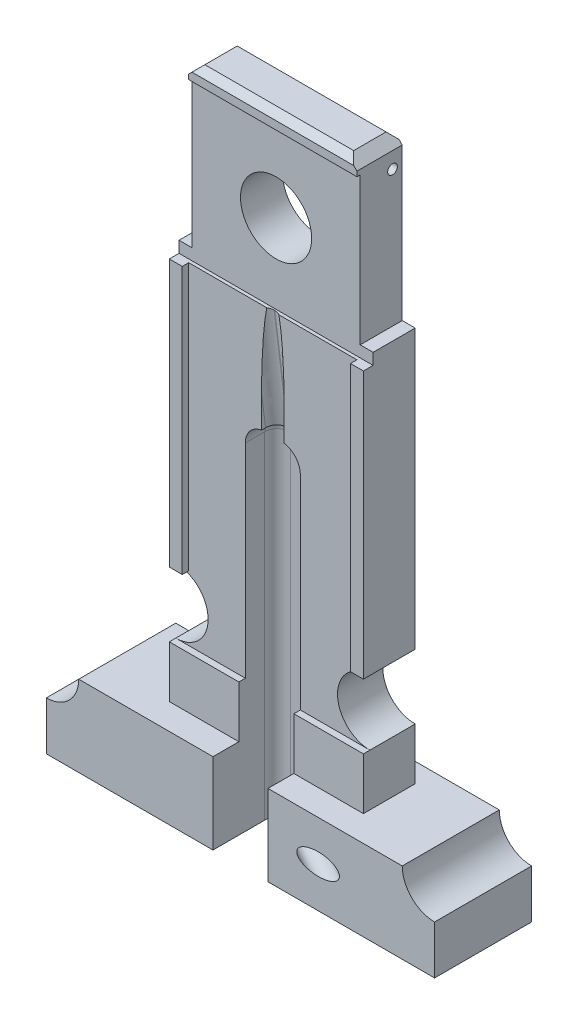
ISO-10303-21;
HEADER;
FILE_DESCRIPTION(('STEP AP214'),'2;1');
FILE_NAME('part.step','',(''),(''),'','','');
FILE_SCHEMA(('AUTOMOTIVE_DESIGN { 1 0 10303 214 1 1 1 1 }'));
ENDSEC;
DATA;
#1=APPLICATION_CONTEXT('core data for automotive mechanical design processes');
#2=APPLICATION_PROTOCOL_DEFINITION('international standard','automotive_design',2000,#1);
#3=PRODUCT_CONTEXT('',#1,'mechanical');
#4=PRODUCT('Part','Part','',(#3));
#5=PRODUCT_RELATED_PRODUCT_CATEGORY('part','',(#4));
#6=PRODUCT_DEFINITION_FORMATION('','',#4);
#7=PRODUCT_DEFINITION_CONTEXT('part definition',#1,'design');
#8=PRODUCT_DEFINITION('design','',#6,#7);
#9=PRODUCT_DEFINITION_SHAPE('','',#8);
#10=(LENGTH_UNIT() NAMED_UNIT(*) SI_UNIT(.MILLI.,.METRE.));
#11=(NAMED_UNIT(*) PLANE_ANGLE_UNIT() SI_UNIT($,.RADIAN.));
#12=(NAMED_UNIT(*) SI_UNIT($,.STERADIAN.) SOLID_ANGLE_UNIT());
#13=UNCERTAINTY_MEASURE_WITH_UNIT(LENGTH_MEASURE(1.E-05),#10,'distance_accuracy_value','');
#14=(GEOMETRIC_REPRESENTATION_CONTEXT(3) GLOBAL_UNCERTAINTY_ASSIGNED_CONTEXT((#13)) GLOBAL_UNIT_ASSIGNED_CONTEXT((#10,
#11,#12)) REPRESENTATION_CONTEXT('',''));
#15=CARTESIAN_POINT('',(0.,0.,0.));
#16=DIRECTION('',(0.,0.,1.));
#17=DIRECTION('',(1.,0.,0.));
#18=AXIS2_PLACEMENT_3D('',#15,#16,#17);
#19=CARTESIAN_POINT('',(0.,0.,-5.));
#20=DIRECTION('',(0.,0.,-1.));
#21=DIRECTION('',(-1.,0.,0.));
#22=AXIS2_PLACEMENT_3D('',#19,#20,#21);
#23=PLANE('',#22);
#24=DIRECTION('',(0.,1.,0.));
#25=VECTOR('',#24,1.);
#26=CARTESIAN_POINT('',(1.75,0.,-5.));
#27=LINE('',#26,#25);
#28=CARTESIAN_POINT('',(1.75,48.7080398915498,-5.));
#29=VERTEX_POINT('',#28);
#30=CARTESIAN_POINT('',(1.75,53.7782895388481,-5.));
#31=VERTEX_POINT('',#30);
#32=EDGE_CURVE('E1529',#29,#31,#27,.T.);
#33=ORIENTED_EDGE('',*,*,#32,.F.);
#34=CARTESIAN_POINT('',(1.25,45.75,-5.));
#35=DIRECTION('',(0.,0.,-1.));
#36=DIRECTION('',(-1.,0.,0.));
#37=AXIS2_PLACEMENT_3D('',#34,#35,#36);
#38=CIRCLE('',#37,3.);
#39=CARTESIAN_POINT('',(4.25,45.75,-5.));
#40=VERTEX_POINT('',#39);
#41=EDGE_CURVE('E1528',#29,#40,#38,.T.);
#42=ORIENTED_EDGE('',*,*,#41,.T.);
#43=DIRECTION('',(0.,-1.,0.));
#44=VECTOR('',#43,1.);
#45=CARTESIAN_POINT('',(4.25,0.,-5.));
#46=LINE('',#45,#44);
#47=CARTESIAN_POINT('',(4.25,14.25,-5.));
#48=VERTEX_POINT('',#47);
#49=EDGE_CURVE('E435',#40,#48,#46,.T.);
#50=ORIENTED_EDGE('',*,*,#49,.T.);
#51=DIRECTION('',(1.,0.,0.));
#52=VECTOR('',#51,1.);
#53=CARTESIAN_POINT('',(-13.,14.25,-5.));
#54=LINE('',#53,#52);
#55=CARTESIAN_POINT('',(15.,14.25,-5.));
#56=VERTEX_POINT('',#55);
#57=EDGE_CURVE('E517',#48,#56,#54,.T.);
#58=ORIENTED_EDGE('',*,*,#57,.T.);
#59=CARTESIAN_POINT('',(15.,19.25,-5.));
#60=DIRECTION('',(0.,0.,-1.));
#61=DIRECTION('',(-1.,0.,0.));
#62=AXIS2_PLACEMENT_3D('',#59,#60,#61);
#63=CIRCLE('',#62,5.);
#64=CARTESIAN_POINT('',(15.,24.25,-5.));
#65=VERTEX_POINT('',#64);
#66=EDGE_CURVE('E581',#65,#56,#63,.F.);
#67=ORIENTED_EDGE('',*,*,#66,.F.);
#68=DIRECTION('',(-1.,0.,0.));
#69=VECTOR('',#68,1.);
#70=CARTESIAN_POINT('',(17.5425295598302,24.25,-5.));
#71=LINE('',#70,#69);
#72=CARTESIAN_POINT('',(13.,24.25,-5.));
#73=VERTEX_POINT('',#72);
#74=EDGE_CURVE('E405',#65,#73,#71,.T.);
#75=ORIENTED_EDGE('',*,*,#74,.T.);
#76=DIRECTION('',(0.,1.,0.));
#77=VECTOR('',#76,1.);
#78=CARTESIAN_POINT('',(13.,14.25,-5.));
#79=LINE('',#78,#77);
#80=CARTESIAN_POINT('',(13.,65.5,-5.));
#81=VERTEX_POINT('',#80);
#82=EDGE_CURVE('E506',#73,#81,#79,.T.);
#83=ORIENTED_EDGE('',*,*,#82,.T.);
#84=DIRECTION('',(-1.,0.,0.));
#85=VECTOR('',#84,1.);
#86=CARTESIAN_POINT('',(0.,65.5,-5.));
#87=LINE('',#86,#85);
#88=CARTESIAN_POINT('',(0.935728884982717,65.5,-5.));
#89=VERTEX_POINT('',#88);
#90=EDGE_CURVE('E587',#81,#89,#87,.T.);
#91=ORIENTED_EDGE('',*,*,#90,.T.);
#92=CARTESIAN_POINT('',(1.75,53.7782895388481,-5.));
#93=CARTESIAN_POINT('',(1.74999714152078,54.0573673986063,-4.99999999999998));
#94=CARTESIAN_POINT('',(1.74894743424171,54.3364440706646,-4.99999999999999));
#95=CARTESIAN_POINT('',(1.74472832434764,54.8945827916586,-5.00000000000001));
#96=CARTESIAN_POINT('',(1.7415589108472,55.1736448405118,-5.00000000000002));
#97=CARTESIAN_POINT('',(1.72883080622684,56.0108734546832,-4.99999999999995));
#98=CARTESIAN_POINT('',(1.71605223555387,56.5689953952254,-4.99999999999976));
#99=CARTESIAN_POINT('',(1.68131748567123,57.6849626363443,-4.99999999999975));
#100=CARTESIAN_POINT('',(1.65936115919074,58.2428079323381,-4.99999999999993));
#101=CARTESIAN_POINT('',(1.60513434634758,59.3579689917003,-5.00000000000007));
#102=CARTESIAN_POINT('',(1.57286470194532,59.9152847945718,-5.00000000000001));
#103=CARTESIAN_POINT('',(1.51513010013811,60.7505829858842,-4.99999999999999));
#104=CARTESIAN_POINT('',(1.49433136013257,61.0288905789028,-5.));
#105=CARTESIAN_POINT('',(1.44918961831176,61.5852334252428,-5.));
#106=CARTESIAN_POINT('',(1.42484646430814,61.8632686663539,-5.));
#107=CARTESIAN_POINT('',(1.37172616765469,62.4222148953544,-5.));
#108=CARTESIAN_POINT('',(1.34290027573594,62.7031212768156,-5.));
#109=CARTESIAN_POINT('',(1.28015166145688,63.2643437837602,-5.));
#110=CARTESIAN_POINT('',(1.24622950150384,63.5446599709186,-5.));
#111=CARTESIAN_POINT('',(1.19042255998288,63.9647782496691,-5.));
#112=CARTESIAN_POINT('',(1.17097667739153,64.1049048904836,-5.));
#113=CARTESIAN_POINT('',(1.13017574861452,64.3848760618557,-5.));
#114=CARTESIAN_POINT('',(1.10882077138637,64.5247206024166,-5.));
#115=CARTESIAN_POINT('',(1.0638563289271,64.8041022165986,-5.));
#116=CARTESIAN_POINT('',(1.04024605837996,64.9436391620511,-5.));
#117=CARTESIAN_POINT('',(0.990225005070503,65.2222259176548,-5.));
#118=CARTESIAN_POINT('',(0.963813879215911,65.3612756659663,-4.99999999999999));
#119=CARTESIAN_POINT('',(0.935728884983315,65.4999999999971,-4.99999999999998));
#120=B_SPLINE_CURVE_WITH_KNOTS('',3,(#92,#93,#94,#95,#96,#97,#98,#99,#100,#101,#102,#103,#104,
#105,#106,#107,#108,#109,#110,#111,#112,#113,#114,#115,#116,#117,#118,#119),.UNSPECIFIED.,.F.,
.F.,(4,2,2,2,2,2,2,2,2,2,2,2,2,4),(0.,0.837229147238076,1.67446259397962,3.34919073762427,
5.02394575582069,6.69856408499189,7.53579764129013,8.37306715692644,9.22017692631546,
10.0671932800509,10.4915912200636,10.9159738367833,11.3405085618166,11.7650953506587),.UNSPECIFIED.);
#121=EDGE_CURVE('E368',#31,#89,#120,.T.);
#122=ORIENTED_EDGE('',*,*,#121,.F.);
#123=EDGE_LOOP('',(#33,#42,#50,#58,#67,#75,#83,#91,#122));
#124=FACE_BOUND('',#123,.T.);
#125=ADVANCED_FACE('F37',(#124),#23,.F.);
#126=DIRECTION('',(0.,-1.,0.));
#127=VECTOR('',#126,1.);
#128=CARTESIAN_POINT('',(-1.75,0.,-5.));
#129=LINE('',#128,#127);
#130=CARTESIAN_POINT('',(-1.75,53.7782895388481,-5.));
#131=VERTEX_POINT('',#130);
#132=CARTESIAN_POINT('',(-1.75,48.7080398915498,-5.));
#133=VERTEX_POINT('',#132);
#134=EDGE_CURVE('E389',#131,#133,#129,.T.);
#135=ORIENTED_EDGE('',*,*,#134,.F.);
#136=CARTESIAN_POINT('',(-0.935728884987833,65.4999999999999,-4.99999999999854));
#137=CARTESIAN_POINT('',(-0.963451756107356,65.3630718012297,-4.99999999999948));
#138=CARTESIAN_POINT('',(-0.989542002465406,65.2258259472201,-4.99999999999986));
#139=CARTESIAN_POINT('',(-1.03898577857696,64.950858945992,-5.00000000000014));
#140=CARTESIAN_POINT('',(-1.06233966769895,64.8131378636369,-5.00000000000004));
#141=CARTESIAN_POINT('',(-1.1068362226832,64.5374066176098,-4.99999999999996));
#142=CARTESIAN_POINT('',(-1.12797988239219,64.3993966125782,-4.99999999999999));
#143=CARTESIAN_POINT('',(-1.16839623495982,64.1230977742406,-5.00000000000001));
#144=CARTESIAN_POINT('',(-1.18766884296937,63.9848089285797,-5.));
#145=CARTESIAN_POINT('',(-1.24307625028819,63.5696494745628,-4.99999999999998));
#146=CARTESIAN_POINT('',(-1.27680515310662,63.292457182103,-4.99999999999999));
#147=CARTESIAN_POINT('',(-1.3392361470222,62.7375105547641,-5.00000000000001));
#148=CARTESIAN_POINT('',(-1.36793810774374,62.4597562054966,-5.));
#149=CARTESIAN_POINT('',(-1.42118988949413,61.903746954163,-5.));
#150=CARTESIAN_POINT('',(-1.44573815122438,61.6254919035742,-5.));
#151=CARTESIAN_POINT('',(-1.49126184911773,61.0686880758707,-5.));
#152=CARTESIAN_POINT('',(-1.51223722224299,60.7901392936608,-5.));
#153=CARTESIAN_POINT('',(-1.57064181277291,59.9516294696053,-4.99999999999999));
#154=CARTESIAN_POINT('',(-1.60331595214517,59.3913344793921,-5.));
#155=CARTESIAN_POINT('',(-1.65820605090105,58.2703636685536,-5.));
#156=CARTESIAN_POINT('',(-1.68042411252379,57.7096879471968,-5.));
#157=CARTESIAN_POINT('',(-1.71560072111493,56.5873323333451,-5.));
#158=CARTESIAN_POINT('',(-1.72854745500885,56.0256520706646,-5.));
#159=CARTESIAN_POINT('',(-1.74144517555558,55.1829945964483,-5.));
#160=CARTESIAN_POINT('',(-1.74465734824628,54.9020628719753,-5.));
#161=CARTESIAN_POINT('',(-1.74893328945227,54.3401843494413,-5.));
#162=CARTESIAN_POINT('',(-1.74999706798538,54.0592375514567,-5.));
#163=CARTESIAN_POINT('',(-1.75,53.7782895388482,-5.));
#164=B_SPLINE_CURVE_WITH_KNOTS('',3,(#136,#137,#138,#139,#140,#141,#142,#143,#144,#145,#146,
#147,#148,#149,#150,#151,#152,#153,#154,#155,#156,#157,#158,#159,#160,#161,#162,#163),
.UNSPECIFIED.,.F.,.F.,(4,2,2,2,2,2,2,2,2,2,2,2,2,4),(0.,0.419091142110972,0.838127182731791,
1.25697398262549,1.67583976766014,2.51348400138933,3.3511499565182,4.18912967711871,
5.02712418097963,6.7107321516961,8.39400148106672,10.0794117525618,10.9222551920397,
11.7650947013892),.UNSPECIFIED.);
#165=CARTESIAN_POINT('',(-0.935728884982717,65.5,-5.));
#166=VERTEX_POINT('',#165);
#167=EDGE_CURVE('E390',#166,#131,#164,.T.);
#168=ORIENTED_EDGE('',*,*,#167,.F.);
#169=CARTESIAN_POINT('',(-13.,65.5,-5.));
#170=VERTEX_POINT('',#169);
#171=EDGE_CURVE('E586',#166,#170,#87,.T.);
#172=ORIENTED_EDGE('',*,*,#171,.T.);
#173=DIRECTION('',(0.,-1.,0.));
#174=VECTOR('',#173,1.);
#175=CARTESIAN_POINT('',(-13.,14.25,-5.));
#176=LINE('',#175,#174);
#177=CARTESIAN_POINT('',(-13.,24.25,-5.));
#178=VERTEX_POINT('',#177);
#179=EDGE_CURVE('E508',#170,#178,#176,.T.);
#180=ORIENTED_EDGE('',*,*,#179,.T.);
#181=CARTESIAN_POINT('',(-15.,24.25,-5.));
#182=VERTEX_POINT('',#181);
#183=EDGE_CURVE('E402',#178,#182,#71,.T.);
#184=ORIENTED_EDGE('',*,*,#183,.T.);
#185=CARTESIAN_POINT('',(-15.,19.25,-5.));
#186=DIRECTION('',(0.,0.,-1.));
#187=DIRECTION('',(-1.,0.,0.));
#188=AXIS2_PLACEMENT_3D('',#185,#186,#187);
#189=CIRCLE('',#188,5.);
#190=CARTESIAN_POINT('',(-15.,14.25,-5.));
#191=VERTEX_POINT('',#190);
#192=EDGE_CURVE('E516',#191,#182,#189,.F.);
#193=ORIENTED_EDGE('',*,*,#192,.F.);
#194=CARTESIAN_POINT('',(-4.25,14.25,-5.));
#195=VERTEX_POINT('',#194);
#196=EDGE_CURVE('E513',#191,#195,#54,.T.);
#197=ORIENTED_EDGE('',*,*,#196,.T.);
#198=DIRECTION('',(0.,1.,0.));
#199=VECTOR('',#198,1.);
#200=CARTESIAN_POINT('',(-4.25,0.,-5.));
#201=LINE('',#200,#199);
#202=CARTESIAN_POINT('',(-4.25,45.75,-5.));
#203=VERTEX_POINT('',#202);
#204=EDGE_CURVE('E444',#195,#203,#201,.T.);
#205=ORIENTED_EDGE('',*,*,#204,.T.);
#206=CARTESIAN_POINT('',(-1.25,45.75,-5.));
#207=DIRECTION('',(0.,0.,-1.));
#208=DIRECTION('',(-1.,0.,0.));
#209=AXIS2_PLACEMENT_3D('',#206,#207,#208);
#210=CIRCLE('',#209,3.);
#211=EDGE_CURVE('E1489',#203,#133,#210,.T.);
#212=ORIENTED_EDGE('',*,*,#211,.T.);
#213=EDGE_LOOP('',(#135,#168,#172,#180,#184,#193,#197,#205,#212));
#214=FACE_BOUND('',#213,.T.);
#215=ADVANCED_FACE('F814',(#214),#23,.F.);
#216=CARTESIAN_POINT('',(-24.1564403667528,65.5,-5.5));
#217=DIRECTION('',(0.,-1.,0.));
#218=DIRECTION('',(0.,0.,-1.));
#219=AXIS2_PLACEMENT_3D('',#216,#217,#218);
#220=PLANE('',#219);
#221=CARTESIAN_POINT('',(1.68907690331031,65.5,-4.));
#222=CARTESIAN_POINT('',(1.67657385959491,65.5,-4.04543595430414));
#223=CARTESIAN_POINT('',(1.66218682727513,65.5,-4.09033070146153));
#224=CARTESIAN_POINT('',(1.62973875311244,65.5,-4.17876987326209));
#225=CARTESIAN_POINT('',(1.61167787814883,65.5,-4.22231435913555));
#226=CARTESIAN_POINT('',(1.5521568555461,65.5,-4.35045484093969));
#227=CARTESIAN_POINT('',(1.50533695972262,65.5,-4.43263518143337));
#228=CARTESIAN_POINT('',(1.3987635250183,65.5,-4.58807113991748));
#229=CARTESIAN_POINT('',(1.33900998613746,65.5,-4.66132675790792));
#230=CARTESIAN_POINT('',(1.20819727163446,65.5,-4.79694981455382));
#231=CARTESIAN_POINT('',(1.13713809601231,65.5,-4.85931725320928));
#232=CARTESIAN_POINT('',(0.985678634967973,65.5,-4.97142835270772));
#233=CARTESIAN_POINT('',(0.905278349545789,65.5,-5.02117201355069));
#234=CARTESIAN_POINT('',(0.737355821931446,65.5,-5.1066682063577));
#235=CARTESIAN_POINT('',(0.649833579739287,65.5,-5.14242073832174));
#236=CARTESIAN_POINT('',(0.477712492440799,65.5,-5.19654233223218));
#237=CARTESIAN_POINT('',(0.393497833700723,65.5,-5.21613098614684));
#238=CARTESIAN_POINT('',(0.265617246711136,65.5,-5.2357976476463));
#239=CARTESIAN_POINT('',(0.222650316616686,65.5,-5.2407338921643));
#240=CARTESIAN_POINT('',(0.136460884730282,65.5,-5.24732096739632));
#241=CARTESIAN_POINT('',(0.0932383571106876,65.5,-5.24897146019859));
#242=CARTESIAN_POINT('',(0.0499999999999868,65.5,-5.24897128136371));
#243=B_SPLINE_CURVE_WITH_KNOTS('',3,(#221,#222,#223,#224,#225,#226,#227,#228,#229,#230,#231,
#232,#233,#234,#235,#236,#237,#238,#239,#240,#241,#242),.UNSPECIFIED.,.F.,.F.,(4,2,2,2,2,2,2,2,
2,2,4),(0.,0.141290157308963,0.282573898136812,0.564903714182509,0.847233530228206,
1.1295633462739,1.4118931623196,1.6942229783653,1.95254704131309,2.08218582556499,
2.21183794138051),.UNSPECIFIED.);
#244=CARTESIAN_POINT('',(0.0499999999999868,65.5,-5.24897128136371));
#245=VERTEX_POINT('',#244);
#246=EDGE_CURVE('E360',#89,#245,#243,.T.);
#247=ORIENTED_EDGE('',*,*,#246,.F.);
#248=ORIENTED_EDGE('',*,*,#90,.F.);
#249=DIRECTION('',(0.,0.,-1.));
#250=VECTOR('',#249,1.);
#251=CARTESIAN_POINT('',(13.,65.5,-5.));
#252=LINE('',#251,#250);
#253=CARTESIAN_POINT('',(13.,65.5,-4.));
#254=VERTEX_POINT('',#253);
#255=EDGE_CURVE('E491',#254,#81,#252,.T.);
#256=ORIENTED_EDGE('',*,*,#255,.F.);
#257=DIRECTION('',(1.,0.,0.));
#258=VECTOR('',#257,1.);
#259=CARTESIAN_POINT('',(-24.1564403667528,65.5,-4.));
#260=LINE('',#259,#258);
#261=CARTESIAN_POINT('',(15.,65.5,-4.));
#262=VERTEX_POINT('',#261);
#263=EDGE_CURVE('E484',#254,#262,#260,.T.);
#264=ORIENTED_EDGE('',*,*,#263,.T.);
#265=DIRECTION('',(0.,0.,-1.));
#266=VECTOR('',#265,1.);
#267=CARTESIAN_POINT('',(15.,65.5,-15.));
#268=LINE('',#267,#266);
#269=CARTESIAN_POINT('',(15.,65.5,-5.5));
#270=VERTEX_POINT('',#269);
#271=EDGE_CURVE('E500',#262,#270,#268,.T.);
#272=ORIENTED_EDGE('',*,*,#271,.T.);
#273=DIRECTION('',(1.,0.,0.));
#274=VECTOR('',#273,1.);
#275=CARTESIAN_POINT('',(-24.1564403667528,65.5,-5.5));
#276=LINE('',#275,#274);
#277=CARTESIAN_POINT('',(-15.,65.5,-5.5));
#278=VERTEX_POINT('',#277);
#279=EDGE_CURVE('E487',#278,#270,#276,.T.);
#280=ORIENTED_EDGE('',*,*,#279,.F.);
#281=DIRECTION('',(0.,0.,1.));
#282=VECTOR('',#281,1.);
#283=CARTESIAN_POINT('',(-15.,65.5,-15.));
#284=LINE('',#283,#282);
#285=CARTESIAN_POINT('',(-15.,65.5,-4.));
#286=VERTEX_POINT('',#285);
#287=EDGE_CURVE('E498',#278,#286,#284,.T.);
#288=ORIENTED_EDGE('',*,*,#287,.T.);
#289=CARTESIAN_POINT('',(-13.,65.5,-4.));
#290=VERTEX_POINT('',#289);
#291=EDGE_CURVE('E488',#286,#290,#260,.T.);
#292=ORIENTED_EDGE('',*,*,#291,.T.);
#293=DIRECTION('',(0.,0.,1.));
#294=VECTOR('',#293,1.);
#295=CARTESIAN_POINT('',(-13.,65.5,-5.));
#296=LINE('',#295,#294);
#297=EDGE_CURVE('E495',#170,#290,#296,.T.);
#298=ORIENTED_EDGE('',*,*,#297,.F.);
#299=ORIENTED_EDGE('',*,*,#171,.F.);
#300=CARTESIAN_POINT('',(-0.0499999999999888,65.5,-5.24897128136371));
#301=CARTESIAN_POINT('',(-0.0971248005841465,65.5,-5.24897096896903));
#302=CARTESIAN_POINT('',(-0.144227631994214,65.5,-5.24701060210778));
#303=CARTESIAN_POINT('',(-0.238106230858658,65.5,-5.23918926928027));
#304=CARTESIAN_POINT('',(-0.284882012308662,65.5,-5.23332847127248));
#305=CARTESIAN_POINT('',(-0.424221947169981,65.5,-5.20993757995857));
#306=CARTESIAN_POINT('',(-0.515879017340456,65.5,-5.18659891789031));
#307=CARTESIAN_POINT('',(-0.694019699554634,65.5,-5.12508365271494));
#308=CARTESIAN_POINT('',(-0.780503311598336,65.5,-5.08690704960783));
#309=CARTESIAN_POINT('',(-0.945972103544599,65.5,-4.99676452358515));
#310=CARTESIAN_POINT('',(-1.02495728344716,65.5,-4.94479860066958));
#311=CARTESIAN_POINT('',(-1.17323442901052,65.5,-4.82851151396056));
#312=CARTESIAN_POINT('',(-1.24252639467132,65.5,-4.76419035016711));
#313=CARTESIAN_POINT('',(-1.36951063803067,65.5,-4.6249680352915));
#314=CARTESIAN_POINT('',(-1.42720291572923,65.5,-4.55006688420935));
#315=CARTESIAN_POINT('',(-1.52457463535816,65.5,-4.399211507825));
#316=CARTESIAN_POINT('',(-1.56543981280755,65.5,-4.32402297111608));
#317=CARTESIAN_POINT('',(-1.61833264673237,65.5,-4.2064242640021));
#318=CARTESIAN_POINT('',(-1.63470261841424,65.5,-4.16591879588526));
#319=CARTESIAN_POINT('',(-1.66428109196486,65.5,-4.08376298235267));
#320=CARTESIAN_POINT('',(-1.67748914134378,65.5,-4.04211247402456));
#321=CARTESIAN_POINT('',(-1.68907690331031,65.5,-3.99999999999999));
#322=B_SPLINE_CURVE_WITH_KNOTS('',3,(#300,#301,#302,#303,#304,#305,#306,#307,#308,#309,#310,
#311,#312,#313,#314,#315,#316,#317,#318,#319,#320,#321),.UNSPECIFIED.,.F.,.F.,(4,2,2,2,2,2,2,2,
2,2,4),(0.,0.141289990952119,0.282573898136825,0.564903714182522,0.847233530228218,
1.12956334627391,1.41189316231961,1.69422297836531,1.94992303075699,2.08087391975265,
2.21184353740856),.UNSPECIFIED.);
#323=CARTESIAN_POINT('',(-0.0499999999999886,65.5,-5.24897128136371));
#324=VERTEX_POINT('',#323);
#325=EDGE_CURVE('E388',#324,#166,#322,.T.);
#326=ORIENTED_EDGE('',*,*,#325,.F.);
#327=DIRECTION('',(-1.,0.,0.));
#328=VECTOR('',#327,1.);
#329=CARTESIAN_POINT('',(-24.1564403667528,65.5,-5.24897128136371));
#330=LINE('',#329,#328);
#331=EDGE_CURVE('E378',#245,#324,#330,.T.);
#332=ORIENTED_EDGE('',*,*,#331,.F.);
#333=EDGE_LOOP('',(#247,#248,#256,#264,#272,#280,#288,#292,#298,#299,#326,#332));
#334=FACE_BOUND('',#333,.T.);
#335=ADVANCED_FACE('F386',(#334),#220,.F.);
#336=CARTESIAN_POINT('',(-1.25,45.75,-10.));
#337=DIRECTION('',(0.,0.,1.));
#338=DIRECTION('',(1.,0.,0.));
#339=AXIS2_PLACEMENT_3D('',#336,#337,#338);
#340=CYLINDRICAL_SURFACE('',#339,3.);
#341=DIRECTION('',(0.,0.,1.));
#342=VECTOR('',#341,1.);
#343=CARTESIAN_POINT('',(-4.25,45.75,-10.));
#344=LINE('',#343,#342);
#345=CARTESIAN_POINT('',(-4.25,45.75,-8.));
#346=VERTEX_POINT('',#345);
#347=EDGE_CURVE('E425',#346,#203,#344,.T.);
#348=ORIENTED_EDGE('',*,*,#347,.F.);
#349=CARTESIAN_POINT('',(-1.25,45.75,-8.));
#350=DIRECTION('',(0.,0.,-1.));
#351=DIRECTION('',(-1.,0.,0.));
#352=AXIS2_PLACEMENT_3D('',#349,#350,#351);
#353=CIRCLE('',#352,3.);
#354=CARTESIAN_POINT('',(-1.25,48.75,-8.));
#355=VERTEX_POINT('',#354);
#356=EDGE_CURVE('E702',#346,#355,#353,.T.);
#357=ORIENTED_EDGE('',*,*,#356,.T.);
#358=DIRECTION('',(0.,0.,1.));
#359=VECTOR('',#358,1.);
#360=CARTESIAN_POINT('',(-1.25,48.75,-10.));
#361=LINE('',#360,#359);
#362=CARTESIAN_POINT('',(-1.24999999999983,48.75,-6.82661063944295));
#363=VERTEX_POINT('',#362);
#364=EDGE_CURVE('E428',#355,#363,#361,.T.);
#365=ORIENTED_EDGE('',*,*,#364,.T.);
#366=CARTESIAN_POINT('',(-1.75,48.7080398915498,-5.62764541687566));
#367=CARTESIAN_POINT('',(-1.75000509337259,48.7080309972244,-5.67414721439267));
#368=CARTESIAN_POINT('',(-1.74809208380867,48.7083621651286,-5.72064773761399));
#369=CARTESIAN_POINT('',(-1.74044833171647,48.7096432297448,-5.81332022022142));
#370=CARTESIAN_POINT('',(-1.73471800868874,48.7105930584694,-5.85949221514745));
#371=CARTESIAN_POINT('',(-1.71948526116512,48.7130457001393,-5.95102874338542));
#372=CARTESIAN_POINT('',(-1.70999633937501,48.7145465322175,-5.99639556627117));
#373=CARTESIAN_POINT('',(-1.68731365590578,48.7179769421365,-6.08616471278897));
#374=CARTESIAN_POINT('',(-1.67411984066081,48.7199065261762,-6.13056702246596));
#375=CARTESIAN_POINT('',(-1.62909673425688,48.7261078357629,-6.26187023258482));
#376=CARTESIAN_POINT('',(-1.59181158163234,48.7307948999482,-6.34695235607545));
#377=CARTESIAN_POINT('',(-1.50870711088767,48.7390799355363,-6.50073915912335));
#378=CARTESIAN_POINT('',(-1.46430261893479,48.742741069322,-6.57021220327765));
#379=CARTESIAN_POINT('',(-1.39000498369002,48.7468370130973,-6.66982331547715));
#380=CARTESIAN_POINT('',(-1.36362332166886,48.7479741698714,-6.70259412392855));
#381=CARTESIAN_POINT('',(-1.30852399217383,48.7495557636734,-6.76613783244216));
#382=CARTESIAN_POINT('',(-1.27980587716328,48.7500000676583,-6.79691034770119));
#383=CARTESIAN_POINT('',(-1.24999999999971,48.75,-6.82661063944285));
#384=B_SPLINE_CURVE_WITH_KNOTS('',3,(#366,#367,#368,#369,#370,#371,#372,#373,#374,#375,#376,
#377,#378,#379,#380,#381,#382,#383),.UNSPECIFIED.,.F.,.F.,(4,2,2,2,2,2,2,2,4),(0.,
0.139462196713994,0.278909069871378,0.41785946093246,0.55681186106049,0.83446132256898,
1.08115734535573,1.20730877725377,1.33348443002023),.UNSPECIFIED.);
#385=CARTESIAN_POINT('',(-1.75,48.7080398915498,-5.62764541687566));
#386=VERTEX_POINT('',#385);
#387=EDGE_CURVE('E1014',#386,#363,#384,.T.);
#388=ORIENTED_EDGE('',*,*,#387,.F.);
#389=DIRECTION('',(0.,0.,1.));
#390=VECTOR('',#389,1.);
#391=CARTESIAN_POINT('',(-1.75,48.7080398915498,-10.));
#392=LINE('',#391,#390);
#393=EDGE_CURVE('E825',#133,#386,#392,.F.);
#394=ORIENTED_EDGE('',*,*,#393,.F.);
#395=ORIENTED_EDGE('',*,*,#211,.F.);
#396=EDGE_LOOP('',(#348,#357,#365,#388,#394,#395));
#397=FACE_BOUND('',#396,.T.);
#398=ADVANCED_FACE('F1025',(#397),#340,.F.);
#399=CARTESIAN_POINT('',(-1.25,48.75,-10.));
#400=DIRECTION('',(0.,1.,0.));
#401=DIRECTION('',(0.,0.,1.));
#402=AXIS2_PLACEMENT_3D('',#399,#400,#401);
#403=PLANE('',#402);
#404=ORIENTED_EDGE('',*,*,#364,.F.);
#405=DIRECTION('',(-1.,0.,0.));
#406=VECTOR('',#405,1.);
#407=CARTESIAN_POINT('',(1.25,48.75,-8.));
#408=LINE('',#407,#406);
#409=CARTESIAN_POINT('',(1.25,48.75,-8.));
#410=VERTEX_POINT('',#409);
#411=EDGE_CURVE('E1506',#355,#410,#408,.F.);
#412=ORIENTED_EDGE('',*,*,#411,.T.);
#413=DIRECTION('',(0.,0.,1.));
#414=VECTOR('',#413,1.);
#415=CARTESIAN_POINT('',(1.25,48.75,-10.));
#416=LINE('',#415,#414);
#417=CARTESIAN_POINT('',(1.25,48.75,-6.82661063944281));
#418=VERTEX_POINT('',#417);
#419=EDGE_CURVE('E430',#410,#418,#416,.T.);
#420=ORIENTED_EDGE('',*,*,#419,.T.);
#421=CARTESIAN_POINT('',(0.0499999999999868,48.75,-7.32245118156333));
#422=CARTESIAN_POINT('',(0.0979024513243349,48.75,-7.3224510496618));
#423=CARTESIAN_POINT('',(0.145782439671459,48.75,-7.320425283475));
#424=CARTESIAN_POINT('',(0.24119722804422,48.75,-7.31234405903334));
#425=CARTESIAN_POINT('',(0.288732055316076,48.75,-7.30628892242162));
#426=CARTESIAN_POINT('',(0.429938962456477,48.75,-7.28218660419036));
#427=CARTESIAN_POINT('',(0.522666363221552,48.75,-7.25820193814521));
#428=CARTESIAN_POINT('',(0.701635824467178,48.75,-7.19543003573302));
#429=CARTESIAN_POINT('',(0.787944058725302,48.75,-7.15683008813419));
#430=CARTESIAN_POINT('',(0.939257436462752,48.75,-7.07344692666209));
#431=CARTESIAN_POINT('',(1.00542137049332,48.75,-7.03075175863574));
#432=CARTESIAN_POINT('',(1.13248709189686,48.75,-6.93571867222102));
#433=CARTESIAN_POINT('',(1.19325825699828,48.75,-6.88320606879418));
#434=CARTESIAN_POINT('',(1.24999999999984,48.75,-6.82661063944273));
#435=B_SPLINE_CURVE_WITH_KNOTS('',3,(#421,#422,#423,#424,#425,#426,#427,#428,#429,#430,#431,
#432,#433,#434),.UNSPECIFIED.,.F.,.F.,(4,2,2,2,2,2,4),(0.,0.143619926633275,0.28722839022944,
0.573103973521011,0.855433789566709,1.09092712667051,1.33109794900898),.UNSPECIFIED.);
#436=CARTESIAN_POINT('',(0.0499999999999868,48.75,-7.32245118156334));
#437=VERTEX_POINT('',#436);
#438=EDGE_CURVE('E373',#437,#418,#435,.T.);
#439=ORIENTED_EDGE('',*,*,#438,.F.);
#440=DIRECTION('',(1.,0.,0.));
#441=VECTOR('',#440,1.);
#442=CARTESIAN_POINT('',(-1.25,48.75,-7.32245118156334));
#443=LINE('',#442,#441);
#444=CARTESIAN_POINT('',(-0.0499999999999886,48.75,-7.32245118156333));
#445=VERTEX_POINT('',#444);
#446=EDGE_CURVE('E381',#445,#437,#443,.T.);
#447=ORIENTED_EDGE('',*,*,#446,.F.);
#448=CARTESIAN_POINT('',(-1.24999999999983,48.75,-6.82661063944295));
#449=CARTESIAN_POINT('',(-1.2166218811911,48.75,-6.85987325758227));
#450=CARTESIAN_POINT('',(-1.18187532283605,48.75,-6.89173234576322));
#451=CARTESIAN_POINT('',(-1.10985730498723,48.75,-6.95245993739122));
#452=CARTESIAN_POINT('',(-1.07258571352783,48.75,-6.98132828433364));
#453=CARTESIAN_POINT('',(-0.957375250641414,48.75,-7.0631183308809));
#454=CARTESIAN_POINT('',(-0.875980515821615,48.75,-7.11128489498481));
#455=CARTESIAN_POINT('',(-0.706368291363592,48.75,-7.1934609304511));
#456=CARTESIAN_POINT('',(-0.618150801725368,48.75,-7.22747040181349));
#457=CARTESIAN_POINT('',(-0.450371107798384,48.75,-7.27659627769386));
#458=CARTESIAN_POINT('',(-0.37139370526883,48.75,-7.29372908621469));
#459=CARTESIAN_POINT('',(-0.211621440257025,48.75,-7.31668907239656));
#460=CARTESIAN_POINT('',(-0.130822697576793,48.75,-7.32248922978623));
#461=CARTESIAN_POINT('',(-0.0500000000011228,48.75,-7.32245118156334));
#462=B_SPLINE_CURVE_WITH_KNOTS('',3,(#448,#449,#450,#451,#452,#453,#454,#455,#456,#457,#458,
#459,#460,#461),.UNSPECIFIED.,.F.,.F.,(4,2,2,2,2,2,4),(0.,0.141283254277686,0.282573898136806,
0.564903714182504,0.847233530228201,1.08887610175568,1.33109411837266),.UNSPECIFIED.);
#463=EDGE_CURVE('E1006',#363,#445,#462,.T.);
#464=ORIENTED_EDGE('',*,*,#463,.F.);
#465=EDGE_LOOP('',(#404,#412,#420,#439,#447,#464));
#466=FACE_BOUND('',#465,.T.);
#467=ADVANCED_FACE('F844',(#466),#403,.F.);
#468=CARTESIAN_POINT('',(1.25,45.75,-10.));
#469=DIRECTION('',(0.,0.,1.));
#470=DIRECTION('',(1.,0.,0.));
#471=AXIS2_PLACEMENT_3D('',#468,#469,#470);
#472=CYLINDRICAL_SURFACE('',#471,3.);
#473=ORIENTED_EDGE('',*,*,#419,.F.);
#474=CARTESIAN_POINT('',(1.25,45.75,-8.));
#475=DIRECTION('',(0.,0.,-1.));
#476=DIRECTION('',(-1.,0.,0.));
#477=AXIS2_PLACEMENT_3D('',#474,#475,#476);
#478=CIRCLE('',#477,3.);
#479=CARTESIAN_POINT('',(4.25,45.75,-8.));
#480=VERTEX_POINT('',#479);
#481=EDGE_CURVE('E1504',#410,#480,#478,.T.);
#482=ORIENTED_EDGE('',*,*,#481,.T.);
#483=DIRECTION('',(0.,0.,1.));
#484=VECTOR('',#483,1.);
#485=CARTESIAN_POINT('',(4.25,45.75,-10.));
#486=LINE('',#485,#484);
#487=EDGE_CURVE('E424',#480,#40,#486,.T.);
#488=ORIENTED_EDGE('',*,*,#487,.T.);
#489=ORIENTED_EDGE('',*,*,#41,.F.);
#490=DIRECTION('',(0.,0.,1.));
#491=VECTOR('',#490,1.);
#492=CARTESIAN_POINT('',(1.75,48.7080398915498,-10.));
#493=LINE('',#492,#491);
#494=CARTESIAN_POINT('',(1.75,48.7080398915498,-5.62764541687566));
#495=VERTEX_POINT('',#494);
#496=EDGE_CURVE('E1488',#495,#29,#493,.T.);
#497=ORIENTED_EDGE('',*,*,#496,.F.);
#498=CARTESIAN_POINT('',(1.24999999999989,48.75,-6.82661063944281));
#499=CARTESIAN_POINT('',(1.28320590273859,48.750000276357,-6.79351751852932));
#500=CARTESIAN_POINT('',(1.31505519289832,48.7494488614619,-6.75910793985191));
#501=CARTESIAN_POINT('',(1.37583740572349,48.7475137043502,-6.68782333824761));
#502=CARTESIAN_POINT('',(1.40477027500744,48.7461299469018,-6.65094827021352));
#503=CARTESIAN_POINT('',(1.48682603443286,48.7411405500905,-6.53696370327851));
#504=CARTESIAN_POINT('',(1.53528188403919,48.7366955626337,-6.456419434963));
#505=CARTESIAN_POINT('',(1.59724928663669,48.7299069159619,-6.33078618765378));
#506=CARTESIAN_POINT('',(1.61608522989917,48.7276296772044,-6.28821791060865));
#507=CARTESIAN_POINT('',(1.65017120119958,48.7232400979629,-6.20164488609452));
#508=CARTESIAN_POINT('',(1.66542035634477,48.7211277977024,-6.15763979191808));
#509=CARTESIAN_POINT('',(1.70237224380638,48.7157951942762,-6.03463426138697));
#510=CARTESIAN_POINT('',(1.72019957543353,48.7129493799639,-5.9544017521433));
#511=CARTESIAN_POINT('',(1.73806520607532,48.7100377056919,-5.8326855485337));
#512=CARTESIAN_POINT('',(1.74254119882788,48.7092932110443,-5.79180985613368));
#513=CARTESIAN_POINT('',(1.74850779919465,48.7082926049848,-5.70984412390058));
#514=CARTESIAN_POINT('',(1.74999906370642,48.7080363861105,-5.66875413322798));
#515=CARTESIAN_POINT('',(1.74999999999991,48.7080398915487,-5.62764541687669));
#516=B_SPLINE_CURVE_WITH_KNOTS('',3,(#498,#499,#500,#501,#502,#503,#504,#505,#506,#507,#508,
#509,#510,#511,#512,#513,#514,#515),.UNSPECIFIED.,.F.,.F.,(4,2,2,2,2,2,2,2,4),(0.,
0.140538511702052,0.281079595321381,0.561844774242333,0.701531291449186,0.841251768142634,
1.0869272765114,1.2102150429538,1.33347567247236),.UNSPECIFIED.);
#517=EDGE_CURVE('E1483',#418,#495,#516,.T.);
#518=ORIENTED_EDGE('',*,*,#517,.F.);
#519=EDGE_LOOP('',(#473,#482,#488,#489,#497,#518));
#520=FACE_BOUND('',#519,.T.);
#521=ADVANCED_FACE('F1089',(#520),#472,.F.);
#522=CARTESIAN_POINT('',(-15.,19.25,-15.));
#523=DIRECTION('',(0.,0.,1.));
#524=DIRECTION('',(1.,0.,0.));
#525=AXIS2_PLACEMENT_3D('',#522,#523,#524);
#526=CYLINDRICAL_SURFACE('',#525,5.);
#527=DIRECTION('',(0.,0.,1.));
#528=VECTOR('',#527,1.);
#529=CARTESIAN_POINT('',(-15.,14.25,-15.));
#530=LINE('',#529,#528);
#531=CARTESIAN_POINT('',(-15.,14.25,-12.));
#532=VERTEX_POINT('',#531);
#533=EDGE_CURVE('E538',#532,#191,#530,.T.);
#534=ORIENTED_EDGE('',*,*,#533,.T.);
#535=ORIENTED_EDGE('',*,*,#192,.T.);
#536=DIRECTION('',(0.,0.,1.));
#537=VECTOR('',#536,1.);
#538=CARTESIAN_POINT('',(-15.,24.25,-15.));
#539=LINE('',#538,#537);
#540=CARTESIAN_POINT('',(-15.,24.25,-12.));
#541=VERTEX_POINT('',#540);
#542=EDGE_CURVE('E534',#182,#541,#539,.F.);
#543=ORIENTED_EDGE('',*,*,#542,.T.);
#544=CARTESIAN_POINT('',(-15.,19.25,-12.));
#545=DIRECTION('',(0.,0.,1.));
#546=DIRECTION('',(1.,0.,0.));
#547=AXIS2_PLACEMENT_3D('',#544,#545,#546);
#548=CIRCLE('',#547,5.);
#549=EDGE_CURVE('E574',#532,#541,#548,.T.);
#550=ORIENTED_EDGE('',*,*,#549,.F.);
#551=EDGE_LOOP('',(#534,#535,#543,#550));
#552=FACE_BOUND('',#551,.T.);
#553=ADVANCED_FACE('F921',(#552),#526,.F.);
#554=CARTESIAN_POINT('',(15.,19.25,-15.));
#555=DIRECTION('',(0.,0.,1.));
#556=DIRECTION('',(1.,0.,0.));
#557=AXIS2_PLACEMENT_3D('',#554,#555,#556);
#558=CYLINDRICAL_SURFACE('',#557,5.);
#559=ORIENTED_EDGE('',*,*,#66,.T.);
#560=DIRECTION('',(0.,0.,1.));
#561=VECTOR('',#560,1.);
#562=CARTESIAN_POINT('',(15.,14.25,-15.));
#563=LINE('',#562,#561);
#564=CARTESIAN_POINT('',(15.,14.25,-12.));
#565=VERTEX_POINT('',#564);
#566=EDGE_CURVE('E527',#56,#565,#563,.F.);
#567=ORIENTED_EDGE('',*,*,#566,.T.);
#568=CARTESIAN_POINT('',(15.,19.25,-12.));
#569=DIRECTION('',(0.,0.,1.));
#570=DIRECTION('',(1.,0.,0.));
#571=AXIS2_PLACEMENT_3D('',#568,#569,#570);
#572=CIRCLE('',#571,5.);
#573=CARTESIAN_POINT('',(15.,24.25,-12.));
#574=VERTEX_POINT('',#573);
#575=EDGE_CURVE('E577',#574,#565,#572,.T.);
#576=ORIENTED_EDGE('',*,*,#575,.F.);
#577=DIRECTION('',(0.,0.,1.));
#578=VECTOR('',#577,1.);
#579=CARTESIAN_POINT('',(15.,24.25,-15.));
#580=LINE('',#579,#578);
#581=EDGE_CURVE('E531',#574,#65,#580,.T.);
#582=ORIENTED_EDGE('',*,*,#581,.T.);
#583=EDGE_LOOP('',(#559,#567,#576,#582));
#584=FACE_BOUND('',#583,.T.);
#585=ADVANCED_FACE('F1088',(#584),#558,.F.);
#586=CARTESIAN_POINT('',(0.,0.,-4.));
#587=DIRECTION('',(0.,0.,-1.));
#588=DIRECTION('',(-1.,0.,0.));
#589=AXIS2_PLACEMENT_3D('',#586,#587,#588);
#590=PLANE('',#589);
#591=DIRECTION('',(1.,0.,0.));
#592=VECTOR('',#591,1.);
#593=CARTESIAN_POINT('',(-13.,14.25,-4.));
#594=LINE('',#593,#592);
#595=CARTESIAN_POINT('',(-15.,14.25,-4.));
#596=VERTEX_POINT('',#595);
#597=CARTESIAN_POINT('',(-4.25,14.25,-4.));
#598=VERTEX_POINT('',#597);
#599=EDGE_CURVE('E523',#596,#598,#594,.T.);
#600=ORIENTED_EDGE('',*,*,#599,.F.);
#601=DIRECTION('',(0.,-1.,0.));
#602=VECTOR('',#601,1.);
#603=CARTESIAN_POINT('',(-15.,6.25,-4.));
#604=LINE('',#603,#602);
#605=CARTESIAN_POINT('',(-15.,6.25,-4.));
#606=VERTEX_POINT('',#605);
#607=EDGE_CURVE('E554',#596,#606,#604,.T.);
#608=ORIENTED_EDGE('',*,*,#607,.T.);
#609=DIRECTION('',(1.,0.,0.));
#610=VECTOR('',#609,1.);
#611=CARTESIAN_POINT('',(-44.5605625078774,6.25,-4.));
#612=LINE('',#611,#610);
#613=CARTESIAN_POINT('',(-4.25,6.25,-4.));
#614=VERTEX_POINT('',#613);
#615=EDGE_CURVE('E551',#606,#614,#612,.T.);
#616=ORIENTED_EDGE('',*,*,#615,.T.);
#617=DIRECTION('',(0.,1.,0.));
#618=VECTOR('',#617,1.);
#619=CARTESIAN_POINT('',(-4.25,0.,-4.));
#620=LINE('',#619,#618);
#621=EDGE_CURVE('E441',#614,#598,#620,.T.);
#622=ORIENTED_EDGE('',*,*,#621,.T.);
#623=EDGE_LOOP('',(#600,#608,#616,#622));
#624=FACE_BOUND('',#623,.T.);
#625=ADVANCED_FACE('F927',(#624),#590,.F.);
#626=CARTESIAN_POINT('',(0.,0.,0.));
#627=DIRECTION('',(0.,0.,-1.));
#628=DIRECTION('',(-1.,0.,0.));
#629=AXIS2_PLACEMENT_3D('',#626,#627,#628);
#630=PLANE('',#629);
#631=DIRECTION('',(1.,0.,0.));
#632=VECTOR('',#631,1.);
#633=CARTESIAN_POINT('',(-30.,-6.25,0.));
#634=LINE('',#633,#632);
#635=CARTESIAN_POINT('',(-30.,-6.25,0.));
#636=VERTEX_POINT('',#635);
#637=CARTESIAN_POINT('',(-4.25,-6.25,0.));
#638=VERTEX_POINT('',#637);
#639=EDGE_CURVE('E648',#636,#638,#634,.T.);
#640=ORIENTED_EDGE('',*,*,#639,.T.);
#641=DIRECTION('',(0.,-1.,0.));
#642=VECTOR('',#641,1.);
#643=CARTESIAN_POINT('',(-4.25,-26.9125371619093,0.));
#644=LINE('',#643,#642);
#645=CARTESIAN_POINT('',(-4.25,6.25,0.));
#646=VERTEX_POINT('',#645);
#647=EDGE_CURVE('E420',#646,#638,#644,.T.);
#648=ORIENTED_EDGE('',*,*,#647,.F.);
#649=DIRECTION('',(-1.,0.,0.));
#650=VECTOR('',#649,1.);
#651=CARTESIAN_POINT('',(-30.,6.25,0.));
#652=LINE('',#651,#650);
#653=CARTESIAN_POINT('',(-25.,6.25,0.));
#654=VERTEX_POINT('',#653);
#655=EDGE_CURVE('E610',#646,#654,#652,.T.);
#656=ORIENTED_EDGE('',*,*,#655,.T.);
#657=CARTESIAN_POINT('',(-30.,6.25,0.));
#658=DIRECTION('',(0.,0.,-1.));
#659=DIRECTION('',(-1.,0.,0.));
#660=AXIS2_PLACEMENT_3D('',#657,#658,#659);
#661=CIRCLE('',#660,5.);
#662=CARTESIAN_POINT('',(-30.,1.25,0.));
#663=VERTEX_POINT('',#662);
#664=EDGE_CURVE('E578',#654,#663,#661,.T.);
#665=ORIENTED_EDGE('',*,*,#664,.T.);
#666=DIRECTION('',(0.,-1.,0.));
#667=VECTOR('',#666,1.);
#668=CARTESIAN_POINT('',(-30.,-6.25,0.));
#669=LINE('',#668,#667);
#670=EDGE_CURVE('E620',#663,#636,#669,.T.);
#671=ORIENTED_EDGE('',*,*,#670,.T.);
#672=EDGE_LOOP('',(#640,#648,#656,#665,#671));
#673=FACE_BOUND('',#672,.T.);
#674=ADVANCED_FACE('F659',(#673),#630,.F.);
#675=CARTESIAN_POINT('',(-13.,14.25,-5.));
#676=DIRECTION('',(0.,-1.,0.));
#677=DIRECTION('',(0.,0.,-1.));
#678=AXIS2_PLACEMENT_3D('',#675,#676,#677);
#679=PLANE('',#678);
#680=ORIENTED_EDGE('',*,*,#599,.T.);
#681=DIRECTION('',(0.,0.,-1.));
#682=VECTOR('',#681,1.);
#683=CARTESIAN_POINT('',(-4.25,14.25,-5.));
#684=LINE('',#683,#682);
#685=EDGE_CURVE('E606',#598,#195,#684,.T.);
#686=ORIENTED_EDGE('',*,*,#685,.T.);
#687=ORIENTED_EDGE('',*,*,#196,.F.);
#688=DIRECTION('',(0.,0.,1.));
#689=VECTOR('',#688,1.);
#690=CARTESIAN_POINT('',(-15.,14.25,-15.));
#691=LINE('',#690,#689);
#692=EDGE_CURVE('E408',#596,#191,#691,.F.);
#693=ORIENTED_EDGE('',*,*,#692,.F.);
#694=EDGE_LOOP('',(#680,#686,#687,#693));
#695=FACE_BOUND('',#694,.T.);
#696=ADVANCED_FACE('F912',(#695),#679,.F.);
#697=DIRECTION('',(0.,1.,0.));
#698=VECTOR('',#697,1.);
#699=CARTESIAN_POINT('',(13.,14.25,-4.));
#700=LINE('',#699,#698);
#701=CARTESIAN_POINT('',(13.,24.25,-4.));
#702=VERTEX_POINT('',#701);
#703=EDGE_CURVE('E505',#702,#254,#700,.T.);
#704=ORIENTED_EDGE('',*,*,#703,.F.);
#705=DIRECTION('',(-1.,0.,0.));
#706=VECTOR('',#705,1.);
#707=CARTESIAN_POINT('',(17.5425295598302,24.25,-4.));
#708=LINE('',#707,#706);
#709=CARTESIAN_POINT('',(15.,24.25,-4.));
#710=VERTEX_POINT('',#709);
#711=EDGE_CURVE('E406',#710,#702,#708,.T.);
#712=ORIENTED_EDGE('',*,*,#711,.F.);
#713=DIRECTION('',(0.,1.,0.));
#714=VECTOR('',#713,1.);
#715=CARTESIAN_POINT('',(15.,6.25,-4.));
#716=LINE('',#715,#714);
#717=EDGE_CURVE('E558',#710,#262,#716,.T.);
#718=ORIENTED_EDGE('',*,*,#717,.T.);
#719=ORIENTED_EDGE('',*,*,#263,.F.);
#720=EDGE_LOOP('',(#704,#712,#718,#719));
#721=FACE_BOUND('',#720,.T.);
#722=ADVANCED_FACE('F923',(#721),#590,.F.);
#723=CARTESIAN_POINT('',(-15.,24.25,-4.));
#724=VERTEX_POINT('',#723);
#725=EDGE_CURVE('E555',#286,#724,#604,.T.);
#726=ORIENTED_EDGE('',*,*,#725,.T.);
#727=CARTESIAN_POINT('',(-13.,24.25,-4.));
#728=VERTEX_POINT('',#727);
#729=EDGE_CURVE('E392',#728,#724,#708,.T.);
#730=ORIENTED_EDGE('',*,*,#729,.F.);
#731=DIRECTION('',(0.,-1.,0.));
#732=VECTOR('',#731,1.);
#733=CARTESIAN_POINT('',(-13.,14.25,-4.));
#734=LINE('',#733,#732);
#735=EDGE_CURVE('E519',#290,#728,#734,.T.);
#736=ORIENTED_EDGE('',*,*,#735,.F.);
#737=ORIENTED_EDGE('',*,*,#291,.F.);
#738=EDGE_LOOP('',(#726,#730,#736,#737));
#739=FACE_BOUND('',#738,.T.);
#740=ADVANCED_FACE('F806',(#739),#590,.F.);
#741=CARTESIAN_POINT('',(-13.,14.25,-5.));
#742=DIRECTION('',(-1.,0.,0.));
#743=DIRECTION('',(0.,-1.,0.));
#744=AXIS2_PLACEMENT_3D('',#741,#742,#743);
#745=PLANE('',#744);
#746=ORIENTED_EDGE('',*,*,#735,.T.);
#747=DIRECTION('',(0.,0.,-1.));
#748=VECTOR('',#747,1.);
#749=CARTESIAN_POINT('',(-13.,24.25,-5.));
#750=LINE('',#749,#748);
#751=EDGE_CURVE('E417',#728,#178,#750,.T.);
#752=ORIENTED_EDGE('',*,*,#751,.T.);
#753=ORIENTED_EDGE('',*,*,#179,.F.);
#754=ORIENTED_EDGE('',*,*,#297,.T.);
#755=EDGE_LOOP('',(#746,#752,#753,#754));
#756=FACE_BOUND('',#755,.T.);
#757=ADVANCED_FACE('F809',(#756),#745,.F.);
#758=CARTESIAN_POINT('',(13.,14.25,-5.));
#759=DIRECTION('',(1.,0.,0.));
#760=DIRECTION('',(0.,0.,-1.));
#761=AXIS2_PLACEMENT_3D('',#758,#759,#760);
#762=PLANE('',#761);
#763=ORIENTED_EDGE('',*,*,#82,.F.);
#764=DIRECTION('',(0.,0.,1.));
#765=VECTOR('',#764,1.);
#766=CARTESIAN_POINT('',(13.,24.25,-5.));
#767=LINE('',#766,#765);
#768=EDGE_CURVE('E414',#73,#702,#767,.T.);
#769=ORIENTED_EDGE('',*,*,#768,.T.);
#770=ORIENTED_EDGE('',*,*,#703,.T.);
#771=ORIENTED_EDGE('',*,*,#255,.T.);
#772=EDGE_LOOP('',(#763,#769,#770,#771));
#773=FACE_BOUND('',#772,.T.);
#774=ADVANCED_FACE('F1138',(#773),#762,.F.);
#775=CARTESIAN_POINT('',(15.,6.25,-4.));
#776=VERTEX_POINT('',#775);
#777=CARTESIAN_POINT('',(15.,14.25,-4.));
#778=VERTEX_POINT('',#777);
#779=EDGE_CURVE('E559',#776,#778,#716,.T.);
#780=ORIENTED_EDGE('',*,*,#779,.T.);
#781=CARTESIAN_POINT('',(4.25,14.25,-4.));
#782=VERTEX_POINT('',#781);
#783=EDGE_CURVE('E522',#782,#778,#594,.T.);
#784=ORIENTED_EDGE('',*,*,#783,.F.);
#785=DIRECTION('',(0.,-1.,0.));
#786=VECTOR('',#785,1.);
#787=CARTESIAN_POINT('',(4.25,0.,-4.));
#788=LINE('',#787,#786);
#789=CARTESIAN_POINT('',(4.25,6.25,-4.));
#790=VERTEX_POINT('',#789);
#791=EDGE_CURVE('E427',#782,#790,#788,.T.);
#792=ORIENTED_EDGE('',*,*,#791,.T.);
#793=EDGE_CURVE('E550',#790,#776,#612,.T.);
#794=ORIENTED_EDGE('',*,*,#793,.T.);
#795=EDGE_LOOP('',(#780,#784,#792,#794));
#796=FACE_BOUND('',#795,.T.);
#797=ADVANCED_FACE('F928',(#796),#590,.F.);
#798=CARTESIAN_POINT('',(15.,6.25,-15.));
#799=DIRECTION('',(1.,0.,0.));
#800=DIRECTION('',(0.,0.,-1.));
#801=AXIS2_PLACEMENT_3D('',#798,#799,#800);
#802=PLANE('',#801);
#803=DIRECTION('',(0.,0.,-1.));
#804=VECTOR('',#803,1.);
#805=CARTESIAN_POINT('',(15.,67.25,1.86908681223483));
#806=LINE('',#805,#804);
#807=CARTESIAN_POINT('',(15.,67.25,-5.5));
#808=VERTEX_POINT('',#807);
#809=CARTESIAN_POINT('',(15.,67.25,-12.));
#810=VERTEX_POINT('',#809);
#811=EDGE_CURVE('E452',#808,#810,#806,.T.);
#812=ORIENTED_EDGE('',*,*,#811,.F.);
#813=DIRECTION('',(0.,1.,0.));
#814=VECTOR('',#813,1.);
#815=CARTESIAN_POINT('',(15.,6.25,-5.5));
#816=LINE('',#815,#814);
#817=EDGE_CURVE('E502',#270,#808,#816,.T.);
#818=ORIENTED_EDGE('',*,*,#817,.F.);
#819=ORIENTED_EDGE('',*,*,#271,.F.);
#820=ORIENTED_EDGE('',*,*,#717,.F.);
#821=DIRECTION('',(0.,0.,1.));
#822=VECTOR('',#821,1.);
#823=CARTESIAN_POINT('',(15.,24.25,-15.));
#824=LINE('',#823,#822);
#825=EDGE_CURVE('E411',#710,#65,#824,.F.);
#826=ORIENTED_EDGE('',*,*,#825,.T.);
#827=ORIENTED_EDGE('',*,*,#581,.F.);
#828=DIRECTION('',(0.,-1.,0.));
#829=VECTOR('',#828,1.);
#830=CARTESIAN_POINT('',(15.,6.25,-12.));
#831=LINE('',#830,#829);
#832=EDGE_CURVE('E548',#810,#574,#831,.T.);
#833=ORIENTED_EDGE('',*,*,#832,.F.);
#834=EDGE_LOOP('',(#812,#818,#819,#820,#826,#827,#833));
#835=FACE_BOUND('',#834,.T.);
#836=ADVANCED_FACE('F937',(#835),#802,.T.);
#837=CARTESIAN_POINT('',(-15.,6.25,-15.));
#838=DIRECTION('',(-1.,0.,0.));
#839=DIRECTION('',(0.,0.,1.));
#840=AXIS2_PLACEMENT_3D('',#837,#838,#839);
#841=PLANE('',#840);
#842=ORIENTED_EDGE('',*,*,#533,.F.);
#843=DIRECTION('',(0.,1.,0.));
#844=VECTOR('',#843,1.);
#845=CARTESIAN_POINT('',(-15.,6.25,-12.));
#846=LINE('',#845,#844);
#847=CARTESIAN_POINT('',(-15.,6.25,-12.));
#848=VERTEX_POINT('',#847);
#849=EDGE_CURVE('E544',#848,#532,#846,.T.);
#850=ORIENTED_EDGE('',*,*,#849,.F.);
#851=DIRECTION('',(0.,0.,1.));
#852=VECTOR('',#851,1.);
#853=CARTESIAN_POINT('',(-15.,6.25,-15.));
#854=LINE('',#853,#852);
#855=EDGE_CURVE('E562',#848,#606,#854,.T.);
#856=ORIENTED_EDGE('',*,*,#855,.T.);
#857=ORIENTED_EDGE('',*,*,#607,.F.);
#858=ORIENTED_EDGE('',*,*,#692,.T.);
#859=EDGE_LOOP('',(#842,#850,#856,#857,#858));
#860=FACE_BOUND('',#859,.T.);
#861=ADVANCED_FACE('F931',(#860),#841,.T.);
#862=CARTESIAN_POINT('',(30.,-6.25,-15.));
#863=DIRECTION('',(1.,0.,0.));
#864=DIRECTION('',(0.,0.,-1.));
#865=AXIS2_PLACEMENT_3D('',#862,#863,#864);
#866=PLANE('',#865);
#867=DIRECTION('',(0.,0.,1.));
#868=VECTOR('',#867,1.);
#869=CARTESIAN_POINT('',(30.,1.25,-15.));
#870=LINE('',#869,#868);
#871=CARTESIAN_POINT('',(30.,1.25,0.));
#872=VERTEX_POINT('',#871);
#873=CARTESIAN_POINT('',(30.,1.25,-15.));
#874=VERTEX_POINT('',#873);
#875=EDGE_CURVE('E680',#872,#874,#870,.F.);
#876=ORIENTED_EDGE('',*,*,#875,.F.);
#877=DIRECTION('',(0.,1.,0.));
#878=VECTOR('',#877,1.);
#879=CARTESIAN_POINT('',(30.,-6.25,0.));
#880=LINE('',#879,#878);
#881=CARTESIAN_POINT('',(30.,-6.25,0.));
#882=VERTEX_POINT('',#881);
#883=EDGE_CURVE('E614',#882,#872,#880,.T.);
#884=ORIENTED_EDGE('',*,*,#883,.F.);
#885=DIRECTION('',(0.,0.,1.));
#886=VECTOR('',#885,1.);
#887=CARTESIAN_POINT('',(30.,-6.25,-15.));
#888=LINE('',#887,#886);
#889=CARTESIAN_POINT('',(30.,-6.25,-15.));
#890=VERTEX_POINT('',#889);
#891=EDGE_CURVE('E643',#890,#882,#888,.T.);
#892=ORIENTED_EDGE('',*,*,#891,.F.);
#893=DIRECTION('',(0.,1.,0.));
#894=VECTOR('',#893,1.);
#895=CARTESIAN_POINT('',(30.,-6.25,-15.));
#896=LINE('',#895,#894);
#897=EDGE_CURVE('E630',#890,#874,#896,.T.);
#898=ORIENTED_EDGE('',*,*,#897,.T.);
#899=EDGE_LOOP('',(#876,#884,#892,#898));
#900=FACE_BOUND('',#899,.T.);
#901=ADVANCED_FACE('F678',(#900),#866,.T.);
#902=CARTESIAN_POINT('',(-30.,-6.25,-15.));
#903=DIRECTION('',(0.,-1.,0.));
#904=DIRECTION('',(0.,0.,-1.));
#905=AXIS2_PLACEMENT_3D('',#902,#903,#904);
#906=PLANE('',#905);
#907=DIRECTION('',(0.,0.,-1.));
#908=VECTOR('',#907,1.);
#909=CARTESIAN_POINT('',(-4.25,-6.25,-15.));
#910=LINE('',#909,#908);
#911=CARTESIAN_POINT('',(-4.25,-6.25,-8.));
#912=VERTEX_POINT('',#911);
#913=EDGE_CURVE('E449',#638,#912,#910,.T.);
#914=ORIENTED_EDGE('',*,*,#913,.F.);
#915=ORIENTED_EDGE('',*,*,#639,.F.);
#916=DIRECTION('',(0.,0.,1.));
#917=VECTOR('',#916,1.);
#918=CARTESIAN_POINT('',(-30.,-6.25,-15.));
#919=LINE('',#918,#917);
#920=CARTESIAN_POINT('',(-30.,-6.25,-15.));
#921=VERTEX_POINT('',#920);
#922=EDGE_CURVE('E637',#921,#636,#919,.T.);
#923=ORIENTED_EDGE('',*,*,#922,.F.);
#924=DIRECTION('',(1.,0.,0.));
#925=VECTOR('',#924,1.);
#926=CARTESIAN_POINT('',(-30.,-6.25,-15.));
#927=LINE('',#926,#925);
#928=EDGE_CURVE('E635',#921,#890,#927,.T.);
#929=ORIENTED_EDGE('',*,*,#928,.T.);
#930=ORIENTED_EDGE('',*,*,#891,.T.);
#931=CARTESIAN_POINT('',(4.25,-6.25,0.));
#932=VERTEX_POINT('',#931);
#933=EDGE_CURVE('E650',#932,#882,#634,.T.);
#934=ORIENTED_EDGE('',*,*,#933,.F.);
#935=DIRECTION('',(0.,0.,1.));
#936=VECTOR('',#935,1.);
#937=CARTESIAN_POINT('',(4.25,-6.25,-15.));
#938=LINE('',#937,#936);
#939=CARTESIAN_POINT('',(4.25,-6.25,-8.));
#940=VERTEX_POINT('',#939);
#941=EDGE_CURVE('E439',#940,#932,#938,.T.);
#942=ORIENTED_EDGE('',*,*,#941,.F.);
#943=CARTESIAN_POINT('',(2.25,-6.25,-8.));
#944=DIRECTION('',(0.,-1.,0.));
#945=DIRECTION('',(0.,0.,-1.));
#946=AXIS2_PLACEMENT_3D('',#943,#944,#945);
#947=CIRCLE('',#946,2.);
#948=CARTESIAN_POINT('',(2.25,-6.25,-10.));
#949=VERTEX_POINT('',#948);
#950=EDGE_CURVE('E686',#940,#949,#947,.F.);
#951=ORIENTED_EDGE('',*,*,#950,.T.);
#952=DIRECTION('',(1.,0.,0.));
#953=VECTOR('',#952,1.);
#954=CARTESIAN_POINT('',(-30.,-6.25,-10.));
#955=LINE('',#954,#953);
#956=CARTESIAN_POINT('',(-2.25,-6.25,-10.));
#957=VERTEX_POINT('',#956);
#958=EDGE_CURVE('E609',#957,#949,#955,.T.);
#959=ORIENTED_EDGE('',*,*,#958,.F.);
#960=CARTESIAN_POINT('',(-2.25,-6.25,-8.));
#961=DIRECTION('',(0.,-1.,0.));
#962=DIRECTION('',(0.,0.,-1.));
#963=AXIS2_PLACEMENT_3D('',#960,#961,#962);
#964=CIRCLE('',#963,2.);
#965=EDGE_CURVE('E697',#957,#912,#964,.F.);
#966=ORIENTED_EDGE('',*,*,#965,.T.);
#967=EDGE_LOOP('',(#914,#915,#923,#929,#930,#934,#942,#951,#959,#966));
#968=FACE_BOUND('',#967,.T.);
#969=ADVANCED_FACE('F682',(#968),#906,.T.);
#970=CARTESIAN_POINT('',(-30.,-6.25,-15.));
#971=DIRECTION('',(-1.,0.,0.));
#972=DIRECTION('',(0.,0.,1.));
#973=AXIS2_PLACEMENT_3D('',#970,#971,#972);
#974=PLANE('',#973);
#975=DIRECTION('',(0.,0.,1.));
#976=VECTOR('',#975,1.);
#977=CARTESIAN_POINT('',(-30.,1.25,-15.));
#978=LINE('',#977,#976);
#979=CARTESIAN_POINT('',(-30.,1.25,-15.));
#980=VERTEX_POINT('',#979);
#981=EDGE_CURVE('E663',#980,#663,#978,.T.);
#982=ORIENTED_EDGE('',*,*,#981,.F.);
#983=DIRECTION('',(0.,-1.,0.));
#984=VECTOR('',#983,1.);
#985=CARTESIAN_POINT('',(-30.,-6.25,-15.));
#986=LINE('',#985,#984);
#987=EDGE_CURVE('E629',#980,#921,#986,.T.);
#988=ORIENTED_EDGE('',*,*,#987,.T.);
#989=ORIENTED_EDGE('',*,*,#922,.T.);
#990=ORIENTED_EDGE('',*,*,#670,.F.);
#991=EDGE_LOOP('',(#982,#988,#989,#990));
#992=FACE_BOUND('',#991,.T.);
#993=ADVANCED_FACE('F662',(#992),#974,.T.);
#994=CARTESIAN_POINT('',(-30.,6.25,-15.));
#995=DIRECTION('',(0.,1.,0.));
#996=DIRECTION('',(0.,0.,1.));
#997=AXIS2_PLACEMENT_3D('',#994,#995,#996);
#998=PLANE('',#997);
#999=DIRECTION('',(0.,0.,1.));
#1000=VECTOR('',#999,1.);
#1001=CARTESIAN_POINT('',(-4.25,6.25,-15.));
#1002=LINE('',#1001,#1000);
#1003=EDGE_CURVE('E447',#614,#646,#1002,.T.);
#1004=ORIENTED_EDGE('',*,*,#1003,.F.);
#1005=ORIENTED_EDGE('',*,*,#615,.F.);
#1006=ORIENTED_EDGE('',*,*,#855,.F.);
#1007=DIRECTION('',(-1.,0.,0.));
#1008=VECTOR('',#1007,1.);
#1009=CARTESIAN_POINT('',(22.168921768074,6.25,-12.));
#1010=LINE('',#1009,#1008);
#1011=CARTESIAN_POINT('',(15.,6.25,-12.));
#1012=VERTEX_POINT('',#1011);
#1013=EDGE_CURVE('E541',#1012,#848,#1010,.T.);
#1014=ORIENTED_EDGE('',*,*,#1013,.F.);
#1015=DIRECTION('',(0.,0.,1.));
#1016=VECTOR('',#1015,1.);
#1017=CARTESIAN_POINT('',(15.,6.25,-15.));
#1018=LINE('',#1017,#1016);
#1019=EDGE_CURVE('E568',#1012,#776,#1018,.T.);
#1020=ORIENTED_EDGE('',*,*,#1019,.T.);
#1021=ORIENTED_EDGE('',*,*,#793,.F.);
#1022=DIRECTION('',(0.,0.,-1.));
#1023=VECTOR('',#1022,1.);
#1024=CARTESIAN_POINT('',(4.25,6.25,-15.));
#1025=LINE('',#1024,#1023);
#1026=CARTESIAN_POINT('',(4.25,6.25,0.));
#1027=VERTEX_POINT('',#1026);
#1028=EDGE_CURVE('E437',#1027,#790,#1025,.T.);
#1029=ORIENTED_EDGE('',*,*,#1028,.F.);
#1030=CARTESIAN_POINT('',(25.,6.25,0.));
#1031=VERTEX_POINT('',#1030);
#1032=EDGE_CURVE('E613',#1031,#1027,#652,.T.);
#1033=ORIENTED_EDGE('',*,*,#1032,.F.);
#1034=DIRECTION('',(0.,0.,1.));
#1035=VECTOR('',#1034,1.);
#1036=CARTESIAN_POINT('',(25.,6.25,-15.));
#1037=LINE('',#1036,#1035);
#1038=CARTESIAN_POINT('',(25.,6.25,-15.));
#1039=VERTEX_POINT('',#1038);
#1040=EDGE_CURVE('E1542',#1039,#1031,#1037,.T.);
#1041=ORIENTED_EDGE('',*,*,#1040,.F.);
#1042=DIRECTION('',(-1.,0.,0.));
#1043=VECTOR('',#1042,1.);
#1044=CARTESIAN_POINT('',(-30.,6.25,-15.));
#1045=LINE('',#1044,#1043);
#1046=CARTESIAN_POINT('',(-25.,6.25,-15.));
#1047=VERTEX_POINT('',#1046);
#1048=EDGE_CURVE('E627',#1039,#1047,#1045,.T.);
#1049=ORIENTED_EDGE('',*,*,#1048,.T.);
#1050=DIRECTION('',(0.,0.,1.));
#1051=VECTOR('',#1050,1.);
#1052=CARTESIAN_POINT('',(-25.,6.25,-15.));
#1053=LINE('',#1052,#1051);
#1054=EDGE_CURVE('E667',#654,#1047,#1053,.F.);
#1055=ORIENTED_EDGE('',*,*,#1054,.F.);
#1056=ORIENTED_EDGE('',*,*,#655,.F.);
#1057=EDGE_LOOP('',(#1004,#1005,#1006,#1014,#1020,#1021,#1029,#1033,#1041,#1049,#1055,#1056));
#1058=FACE_BOUND('',#1057,.T.);
#1059=ADVANCED_FACE('F947',(#1058),#998,.T.);
#1060=CARTESIAN_POINT('',(0.,0.,-15.));
#1061=DIRECTION('',(0.,0.,-1.));
#1062=DIRECTION('',(-1.,0.,0.));
#1063=AXIS2_PLACEMENT_3D('',#1060,#1061,#1062);
#1064=PLANE('',#1063);
#1065=CARTESIAN_POINT('',(-30.,6.25,-15.));
#1066=DIRECTION('',(0.,0.,1.));
#1067=DIRECTION('',(1.,0.,0.));
#1068=AXIS2_PLACEMENT_3D('',#1065,#1066,#1067);
#1069=CIRCLE('',#1068,5.);
#1070=EDGE_CURVE('E572',#980,#1047,#1069,.T.);
#1071=ORIENTED_EDGE('',*,*,#1070,.T.);
#1072=ORIENTED_EDGE('',*,*,#1048,.F.);
#1073=CARTESIAN_POINT('',(30.,6.25,-15.));
#1074=DIRECTION('',(0.,0.,1.));
#1075=DIRECTION('',(1.,0.,0.));
#1076=AXIS2_PLACEMENT_3D('',#1073,#1074,#1075);
#1077=CIRCLE('',#1076,5.);
#1078=EDGE_CURVE('E675',#1039,#874,#1077,.T.);
#1079=ORIENTED_EDGE('',*,*,#1078,.T.);
#1080=ORIENTED_EDGE('',*,*,#897,.F.);
#1081=ORIENTED_EDGE('',*,*,#928,.F.);
#1082=ORIENTED_EDGE('',*,*,#987,.F.);
#1083=EDGE_LOOP('',(#1071,#1072,#1079,#1080,#1081,#1082));
#1084=FACE_BOUND('',#1083,.T.);
#1085=ADVANCED_FACE('F671',(#1084),#1064,.T.);
#1086=CARTESIAN_POINT('',(12.,0.,0.));
#1087=DIRECTION('',(0.,0.,-1.));
#1088=DIRECTION('',(-1.,0.,0.));
#1089=AXIS2_PLACEMENT_3D('',#1086,#1087,#1088);
#1090=ELLIPSE('',#1089,3.30000000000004,1.65);
#1091=CARTESIAN_POINT('',(8.69999999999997,0.,0.));
#1092=VERTEX_POINT('',#1091);
#1093=EDGE_CURVE('E709',#1092,#1092,#1090,.T.);
#1094=ORIENTED_EDGE('',*,*,#1093,.T.);
#1095=EDGE_LOOP('',(#1094));
#1096=FACE_BOUND('',#1095,.T.);
#1097=ORIENTED_EDGE('',*,*,#1032,.T.);
#1098=DIRECTION('',(0.,1.,0.));
#1099=VECTOR('',#1098,1.);
#1100=CARTESIAN_POINT('',(4.25,-26.9125371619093,0.));
#1101=LINE('',#1100,#1099);
#1102=EDGE_CURVE('E422',#932,#1027,#1101,.T.);
#1103=ORIENTED_EDGE('',*,*,#1102,.F.);
#1104=ORIENTED_EDGE('',*,*,#933,.T.);
#1105=ORIENTED_EDGE('',*,*,#883,.T.);
#1106=CARTESIAN_POINT('',(30.,6.25,0.));
#1107=DIRECTION('',(0.,0.,1.));
#1108=DIRECTION('',(1.,0.,0.));
#1109=AXIS2_PLACEMENT_3D('',#1106,#1107,#1108);
#1110=CIRCLE('',#1109,5.);
#1111=EDGE_CURVE('E666',#1031,#872,#1110,.T.);
#1112=ORIENTED_EDGE('',*,*,#1111,.F.);
#1113=EDGE_LOOP('',(#1097,#1103,#1104,#1105,#1112));
#1114=FACE_BOUND('',#1113,.T.);
#1115=ADVANCED_FACE('F943',(#1096,#1114),#630,.F.);
#1116=CARTESIAN_POINT('',(30.,6.25,-15.));
#1117=DIRECTION('',(0.,0.,1.));
#1118=DIRECTION('',(1.,0.,0.));
#1119=AXIS2_PLACEMENT_3D('',#1116,#1117,#1118);
#1120=CYLINDRICAL_SURFACE('',#1119,5.);
#1121=ORIENTED_EDGE('',*,*,#875,.T.);
#1122=ORIENTED_EDGE('',*,*,#1078,.F.);
#1123=ORIENTED_EDGE('',*,*,#1040,.T.);
#1124=ORIENTED_EDGE('',*,*,#1111,.T.);
#1125=EDGE_LOOP('',(#1121,#1122,#1123,#1124));
#1126=FACE_BOUND('',#1125,.T.);
#1127=ADVANCED_FACE('F940',(#1126),#1120,.F.);
#1128=CARTESIAN_POINT('',(-30.,6.25,-15.));
#1129=DIRECTION('',(0.,0.,1.));
#1130=DIRECTION('',(1.,0.,0.));
#1131=AXIS2_PLACEMENT_3D('',#1128,#1129,#1130);
#1132=CYLINDRICAL_SURFACE('',#1131,5.);
#1133=ORIENTED_EDGE('',*,*,#981,.T.);
#1134=ORIENTED_EDGE('',*,*,#664,.F.);
#1135=ORIENTED_EDGE('',*,*,#1054,.T.);
#1136=ORIENTED_EDGE('',*,*,#1070,.F.);
#1137=EDGE_LOOP('',(#1133,#1134,#1135,#1136));
#1138=FACE_BOUND('',#1137,.T.);
#1139=ADVANCED_FACE('F935',(#1138),#1132,.F.);
#1140=EDGE_CURVE('E528',#778,#56,#563,.F.);
#1141=ORIENTED_EDGE('',*,*,#1140,.F.);
#1142=ORIENTED_EDGE('',*,*,#779,.F.);
#1143=ORIENTED_EDGE('',*,*,#1019,.F.);
#1144=EDGE_CURVE('E547',#565,#1012,#831,.T.);
#1145=ORIENTED_EDGE('',*,*,#1144,.F.);
#1146=ORIENTED_EDGE('',*,*,#566,.F.);
#1147=EDGE_LOOP('',(#1141,#1142,#1143,#1145,#1146));
#1148=FACE_BOUND('',#1147,.T.);
#1149=ADVANCED_FACE('F930',(#1148),#802,.T.);
#1150=DIRECTION('',(0.,0.,1.));
#1151=VECTOR('',#1150,1.);
#1152=CARTESIAN_POINT('',(-15.,67.25,-19.9396176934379));
#1153=LINE('',#1152,#1151);
#1154=CARTESIAN_POINT('',(-15.,67.25,-12.));
#1155=VERTEX_POINT('',#1154);
#1156=CARTESIAN_POINT('',(-15.,67.25,-5.5));
#1157=VERTEX_POINT('',#1156);
#1158=EDGE_CURVE('E465',#1155,#1157,#1153,.T.);
#1159=ORIENTED_EDGE('',*,*,#1158,.F.);
#1160=EDGE_CURVE('E543',#541,#1155,#846,.T.);
#1161=ORIENTED_EDGE('',*,*,#1160,.F.);
#1162=ORIENTED_EDGE('',*,*,#542,.F.);
#1163=EDGE_CURVE('E535',#724,#182,#539,.F.);
#1164=ORIENTED_EDGE('',*,*,#1163,.F.);
#1165=ORIENTED_EDGE('',*,*,#725,.F.);
#1166=ORIENTED_EDGE('',*,*,#287,.F.);
#1167=DIRECTION('',(0.,-1.,0.));
#1168=VECTOR('',#1167,1.);
#1169=CARTESIAN_POINT('',(-15.,6.25,-5.5));
#1170=LINE('',#1169,#1168);
#1171=EDGE_CURVE('E589',#1157,#278,#1170,.T.);
#1172=ORIENTED_EDGE('',*,*,#1171,.F.);
#1173=EDGE_LOOP('',(#1159,#1161,#1162,#1164,#1165,#1166,#1172));
#1174=FACE_BOUND('',#1173,.T.);
#1175=ADVANCED_FACE('F797',(#1174),#841,.T.);
#1176=CARTESIAN_POINT('',(-15.,92.25,-15.));
#1177=DIRECTION('',(0.,1.,0.));
#1178=DIRECTION('',(0.,0.,1.));
#1179=AXIS2_PLACEMENT_3D('',#1176,#1177,#1178);
#1180=PLANE('',#1179);
#1181=DIRECTION('',(0.,0.,-1.));
#1182=VECTOR('',#1181,1.);
#1183=CARTESIAN_POINT('',(11.5,92.25,-12.));
#1184=LINE('',#1183,#1182);
#1185=CARTESIAN_POINT('',(11.5,92.25,-6.));
#1186=VERTEX_POINT('',#1185);
#1187=CARTESIAN_POINT('',(11.5,92.25,-11.));
#1188=VERTEX_POINT('',#1187);
#1189=EDGE_CURVE('E732',#1186,#1188,#1184,.T.);
#1190=ORIENTED_EDGE('',*,*,#1189,.T.);
#1191=DIRECTION('',(-1.,0.,0.));
#1192=VECTOR('',#1191,1.);
#1193=CARTESIAN_POINT('',(-11.5,92.25,-11.));
#1194=LINE('',#1193,#1192);
#1195=CARTESIAN_POINT('',(-11.5,92.25,-11.));
#1196=VERTEX_POINT('',#1195);
#1197=EDGE_CURVE('E752',#1188,#1196,#1194,.T.);
#1198=ORIENTED_EDGE('',*,*,#1197,.T.);
#1199=DIRECTION('',(0.,0.,1.));
#1200=VECTOR('',#1199,1.);
#1201=CARTESIAN_POINT('',(-11.5,92.25,-5.));
#1202=LINE('',#1201,#1200);
#1203=CARTESIAN_POINT('',(-11.5,92.25,-6.));
#1204=VERTEX_POINT('',#1203);
#1205=EDGE_CURVE('E730',#1196,#1204,#1202,.T.);
#1206=ORIENTED_EDGE('',*,*,#1205,.T.);
#1207=DIRECTION('',(1.,0.,0.));
#1208=VECTOR('',#1207,1.);
#1209=CARTESIAN_POINT('',(11.5,92.25,-6.));
#1210=LINE('',#1209,#1208);
#1211=EDGE_CURVE('E750',#1204,#1186,#1210,.T.);
#1212=ORIENTED_EDGE('',*,*,#1211,.T.);
#1213=EDGE_LOOP('',(#1190,#1198,#1206,#1212));
#1214=FACE_BOUND('',#1213,.T.);
#1215=ADVANCED_FACE('F770',(#1214),#1180,.T.);
#1216=CARTESIAN_POINT('',(0.,0.,-12.));
#1217=DIRECTION('',(0.,0.,1.));
#1218=DIRECTION('',(1.,0.,0.));
#1219=AXIS2_PLACEMENT_3D('',#1216,#1217,#1218);
#1220=PLANE('',#1219);
#1221=CARTESIAN_POINT('',(0.,77.75,-12.));
#1222=DIRECTION('',(0.,0.,1.));
#1223=DIRECTION('',(1.,0.,0.));
#1224=AXIS2_PLACEMENT_3D('',#1221,#1222,#1223);
#1225=CIRCLE('',#1224,5.5);
#1226=CARTESIAN_POINT('',(5.5,77.75,-12.));
#1227=VERTEX_POINT('',#1226);
#1228=EDGE_CURVE('E481',#1227,#1227,#1225,.T.);
#1229=ORIENTED_EDGE('',*,*,#1228,.T.);
#1230=EDGE_LOOP('',(#1229));
#1231=FACE_BOUND('',#1230,.T.);
#1232=DIRECTION('',(0.707106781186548,0.707106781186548,0.));
#1233=VECTOR('',#1232,1.);
#1234=CARTESIAN_POINT('',(-13.,90.75,-12.));
#1235=LINE('',#1234,#1233);
#1236=CARTESIAN_POINT('',(-13.,90.75,-12.));
#1237=VERTEX_POINT('',#1236);
#1238=CARTESIAN_POINT('',(-12.5,91.25,-12.));
#1239=VERTEX_POINT('',#1238);
#1240=EDGE_CURVE('E735',#1237,#1239,#1235,.T.);
#1241=ORIENTED_EDGE('',*,*,#1240,.T.);
#1242=DIRECTION('',(1.,0.,0.));
#1243=VECTOR('',#1242,1.);
#1244=CARTESIAN_POINT('',(11.5,91.25,-12.));
#1245=LINE('',#1244,#1243);
#1246=CARTESIAN_POINT('',(12.5,91.25,-12.));
#1247=VERTEX_POINT('',#1246);
#1248=EDGE_CURVE('E743',#1239,#1247,#1245,.T.);
#1249=ORIENTED_EDGE('',*,*,#1248,.T.);
#1250=DIRECTION('',(0.707106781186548,-0.707106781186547,0.));
#1251=VECTOR('',#1250,1.);
#1252=CARTESIAN_POINT('',(13.,90.75,-12.));
#1253=LINE('',#1252,#1251);
#1254=CARTESIAN_POINT('',(13.,90.75,-12.));
#1255=VERTEX_POINT('',#1254);
#1256=EDGE_CURVE('E738',#1247,#1255,#1253,.T.);
#1257=ORIENTED_EDGE('',*,*,#1256,.T.);
#1258=DIRECTION('',(0.,-1.,0.));
#1259=VECTOR('',#1258,1.);
#1260=CARTESIAN_POINT('',(13.,0.,-12.));
#1261=LINE('',#1260,#1259);
#1262=CARTESIAN_POINT('',(13.,67.25,-12.));
#1263=VERTEX_POINT('',#1262);
#1264=EDGE_CURVE('E460',#1255,#1263,#1261,.T.);
#1265=ORIENTED_EDGE('',*,*,#1264,.T.);
#1266=DIRECTION('',(1.,0.,0.));
#1267=VECTOR('',#1266,1.);
#1268=CARTESIAN_POINT('',(0.,67.25,-12.));
#1269=LINE('',#1268,#1267);
#1270=EDGE_CURVE('E462',#1263,#810,#1269,.T.);
#1271=ORIENTED_EDGE('',*,*,#1270,.T.);
#1272=ORIENTED_EDGE('',*,*,#832,.T.);
#1273=ORIENTED_EDGE('',*,*,#575,.T.);
#1274=ORIENTED_EDGE('',*,*,#1144,.T.);
#1275=ORIENTED_EDGE('',*,*,#1013,.T.);
#1276=ORIENTED_EDGE('',*,*,#849,.T.);
#1277=ORIENTED_EDGE('',*,*,#549,.T.);
#1278=ORIENTED_EDGE('',*,*,#1160,.T.);
#1279=DIRECTION('',(1.,0.,0.));
#1280=VECTOR('',#1279,1.);
#1281=CARTESIAN_POINT('',(0.,67.25,-12.));
#1282=LINE('',#1281,#1280);
#1283=CARTESIAN_POINT('',(-13.,67.25,-12.));
#1284=VERTEX_POINT('',#1283);
#1285=EDGE_CURVE('E475',#1155,#1284,#1282,.T.);
#1286=ORIENTED_EDGE('',*,*,#1285,.T.);
#1287=DIRECTION('',(0.,1.,0.));
#1288=VECTOR('',#1287,1.);
#1289=CARTESIAN_POINT('',(-13.,0.,-12.));
#1290=LINE('',#1289,#1288);
#1291=EDGE_CURVE('E472',#1284,#1237,#1290,.T.);
#1292=ORIENTED_EDGE('',*,*,#1291,.T.);
#1293=EDGE_LOOP('',(#1241,#1249,#1257,#1265,#1271,#1272,#1273,#1274,#1275,#1276,#1277,#1278,
#1286,#1292));
#1294=FACE_BOUND('',#1293,.T.);
#1295=ADVANCED_FACE('F761',(#1231,#1294),#1220,.F.);
#1296=DIRECTION('',(-0.707106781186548,0.707106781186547,0.));
#1297=VECTOR('',#1296,1.);
#1298=CARTESIAN_POINT('',(13.,90.75,-5.));
#1299=LINE('',#1298,#1297);
#1300=CARTESIAN_POINT('',(13.,90.75,-5.));
#1301=VERTEX_POINT('',#1300);
#1302=CARTESIAN_POINT('',(12.5,91.25,-5.));
#1303=VERTEX_POINT('',#1302);
#1304=EDGE_CURVE('E727',#1301,#1303,#1299,.T.);
#1305=ORIENTED_EDGE('',*,*,#1304,.T.);
#1306=DIRECTION('',(-1.,0.,0.));
#1307=VECTOR('',#1306,1.);
#1308=CARTESIAN_POINT('',(-11.5,91.25,-5.));
#1309=LINE('',#1308,#1307);
#1310=CARTESIAN_POINT('',(-12.5,91.25,-5.));
#1311=VERTEX_POINT('',#1310);
#1312=EDGE_CURVE('E11',#1303,#1311,#1309,.T.);
#1313=ORIENTED_EDGE('',*,*,#1312,.T.);
#1314=DIRECTION('',(-0.707106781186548,-0.707106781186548,0.));
#1315=VECTOR('',#1314,1.);
#1316=CARTESIAN_POINT('',(-13.,90.75,-5.));
#1317=LINE('',#1316,#1315);
#1318=CARTESIAN_POINT('',(-13.,90.75,-5.));
#1319=VERTEX_POINT('',#1318);
#1320=EDGE_CURVE('E725',#1311,#1319,#1317,.T.);
#1321=ORIENTED_EDGE('',*,*,#1320,.T.);
#1322=CARTESIAN_POINT('',(-13.,90.,-5.));
#1323=VERTEX_POINT('',#1322);
#1324=EDGE_CURVE('E512',#1319,#1323,#176,.T.);
#1325=ORIENTED_EDGE('',*,*,#1324,.T.);
#1326=DIRECTION('',(1.,0.,0.));
#1327=VECTOR('',#1326,1.);
#1328=CARTESIAN_POINT('',(0.,90.,-5.));
#1329=LINE('',#1328,#1327);
#1330=CARTESIAN_POINT('',(13.,90.,-5.));
#1331=VERTEX_POINT('',#1330);
#1332=EDGE_CURVE('E583',#1323,#1331,#1329,.T.);
#1333=ORIENTED_EDGE('',*,*,#1332,.T.);
#1334=EDGE_CURVE('E509',#1331,#1301,#79,.T.);
#1335=ORIENTED_EDGE('',*,*,#1334,.T.);
#1336=EDGE_LOOP('',(#1305,#1313,#1321,#1325,#1333,#1335));
#1337=FACE_BOUND('',#1336,.T.);
#1338=ADVANCED_FACE('F773',(#1337),#23,.F.);
#1339=ORIENTED_EDGE('',*,*,#57,.F.);
#1340=DIRECTION('',(0.,0.,1.));
#1341=VECTOR('',#1340,1.);
#1342=CARTESIAN_POINT('',(4.25,14.25,-5.));
#1343=LINE('',#1342,#1341);
#1344=EDGE_CURVE('E603',#48,#782,#1343,.T.);
#1345=ORIENTED_EDGE('',*,*,#1344,.T.);
#1346=ORIENTED_EDGE('',*,*,#783,.T.);
#1347=ORIENTED_EDGE('',*,*,#1140,.T.);
#1348=EDGE_LOOP('',(#1339,#1345,#1346,#1347));
#1349=FACE_BOUND('',#1348,.T.);
#1350=ADVANCED_FACE('F906',(#1349),#679,.F.);
#1351=CARTESIAN_POINT('',(-24.1564403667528,90.,-5.5));
#1352=DIRECTION('',(0.,1.,0.));
#1353=DIRECTION('',(0.,0.,1.));
#1354=AXIS2_PLACEMENT_3D('',#1351,#1352,#1353);
#1355=PLANE('',#1354);
#1356=DIRECTION('',(-1.,0.,0.));
#1357=VECTOR('',#1356,1.);
#1358=CARTESIAN_POINT('',(-24.1564403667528,90.,-5.5));
#1359=LINE('',#1358,#1357);
#1360=CARTESIAN_POINT('',(13.,90.,-5.5));
#1361=VERTEX_POINT('',#1360);
#1362=CARTESIAN_POINT('',(-13.,90.,-5.5));
#1363=VERTEX_POINT('',#1362);
#1364=EDGE_CURVE('E485',#1361,#1363,#1359,.T.);
#1365=ORIENTED_EDGE('',*,*,#1364,.F.);
#1366=DIRECTION('',(0.,0.,1.));
#1367=VECTOR('',#1366,1.);
#1368=CARTESIAN_POINT('',(13.,90.,-5.5));
#1369=LINE('',#1368,#1367);
#1370=EDGE_CURVE('E456',#1361,#1331,#1369,.T.);
#1371=ORIENTED_EDGE('',*,*,#1370,.T.);
#1372=ORIENTED_EDGE('',*,*,#1332,.F.);
#1373=DIRECTION('',(0.,0.,-1.));
#1374=VECTOR('',#1373,1.);
#1375=CARTESIAN_POINT('',(-13.,90.,-5.5));
#1376=LINE('',#1375,#1374);
#1377=EDGE_CURVE('E468',#1323,#1363,#1376,.T.);
#1378=ORIENTED_EDGE('',*,*,#1377,.T.);
#1379=EDGE_LOOP('',(#1365,#1371,#1372,#1378));
#1380=FACE_BOUND('',#1379,.T.);
#1381=ADVANCED_FACE('F780',(#1380),#1355,.F.);
#1382=CARTESIAN_POINT('',(0.,0.,-5.5));
#1383=DIRECTION('',(0.,0.,-1.));
#1384=DIRECTION('',(-1.,0.,0.));
#1385=AXIS2_PLACEMENT_3D('',#1382,#1383,#1384);
#1386=PLANE('',#1385);
#1387=CARTESIAN_POINT('',(0.,77.75,-5.5));
#1388=DIRECTION('',(0.,0.,1.));
#1389=DIRECTION('',(1.,0.,0.));
#1390=AXIS2_PLACEMENT_3D('',#1387,#1388,#1389);
#1391=CIRCLE('',#1390,5.5);
#1392=CARTESIAN_POINT('',(5.5,77.75,-5.5));
#1393=VERTEX_POINT('',#1392);
#1394=EDGE_CURVE('E478',#1393,#1393,#1391,.T.);
#1395=ORIENTED_EDGE('',*,*,#1394,.F.);
#1396=EDGE_LOOP('',(#1395));
#1397=FACE_BOUND('',#1396,.T.);
#1398=ORIENTED_EDGE('',*,*,#817,.T.);
#1399=DIRECTION('',(-1.,0.,0.));
#1400=VECTOR('',#1399,1.);
#1401=CARTESIAN_POINT('',(0.,67.25,-5.5));
#1402=LINE('',#1401,#1400);
#1403=CARTESIAN_POINT('',(13.,67.25,-5.5));
#1404=VERTEX_POINT('',#1403);
#1405=EDGE_CURVE('E600',#808,#1404,#1402,.T.);
#1406=ORIENTED_EDGE('',*,*,#1405,.T.);
#1407=DIRECTION('',(0.,1.,0.));
#1408=VECTOR('',#1407,1.);
#1409=CARTESIAN_POINT('',(13.,0.,-5.5));
#1410=LINE('',#1409,#1408);
#1411=EDGE_CURVE('E597',#1404,#1361,#1410,.T.);
#1412=ORIENTED_EDGE('',*,*,#1411,.T.);
#1413=ORIENTED_EDGE('',*,*,#1364,.T.);
#1414=DIRECTION('',(0.,-1.,0.));
#1415=VECTOR('',#1414,1.);
#1416=CARTESIAN_POINT('',(-13.,0.,-5.5));
#1417=LINE('',#1416,#1415);
#1418=CARTESIAN_POINT('',(-13.,67.25,-5.5));
#1419=VERTEX_POINT('',#1418);
#1420=EDGE_CURVE('E591',#1363,#1419,#1417,.T.);
#1421=ORIENTED_EDGE('',*,*,#1420,.T.);
#1422=DIRECTION('',(-1.,0.,0.));
#1423=VECTOR('',#1422,1.);
#1424=CARTESIAN_POINT('',(0.,67.25,-5.5));
#1425=LINE('',#1424,#1423);
#1426=EDGE_CURVE('E594',#1419,#1157,#1425,.T.);
#1427=ORIENTED_EDGE('',*,*,#1426,.T.);
#1428=ORIENTED_EDGE('',*,*,#1171,.T.);
#1429=ORIENTED_EDGE('',*,*,#279,.T.);
#1430=EDGE_LOOP('',(#1398,#1406,#1412,#1413,#1421,#1427,#1428,#1429));
#1431=FACE_BOUND('',#1430,.T.);
#1432=ADVANCED_FACE('F784',(#1397,#1431),#1386,.F.);
#1433=CARTESIAN_POINT('',(0.,77.75,-15.));
#1434=DIRECTION('',(0.,0.,1.));
#1435=DIRECTION('',(1.,0.,0.));
#1436=AXIS2_PLACEMENT_3D('',#1433,#1434,#1435);
#1437=CYLINDRICAL_SURFACE('',#1436,5.5);
#1438=ORIENTED_EDGE('',*,*,#1394,.T.);
#1439=EDGE_LOOP('',(#1438));
#1440=FACE_BOUND('',#1439,.T.);
#1441=ORIENTED_EDGE('',*,*,#1228,.F.);
#1442=EDGE_LOOP('',(#1441));
#1443=FACE_BOUND('',#1442,.T.);
#1444=ADVANCED_FACE('F1032',(#1440,#1443),#1437,.F.);
#1445=CARTESIAN_POINT('',(-13.,67.25,-19.9396176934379));
#1446=DIRECTION('',(0.,-1.,0.));
#1447=DIRECTION('',(0.,0.,-1.));
#1448=AXIS2_PLACEMENT_3D('',#1445,#1446,#1447);
#1449=PLANE('',#1448);
#1450=ORIENTED_EDGE('',*,*,#1158,.T.);
#1451=ORIENTED_EDGE('',*,*,#1426,.F.);
#1452=DIRECTION('',(0.,0.,1.));
#1453=VECTOR('',#1452,1.);
#1454=CARTESIAN_POINT('',(-13.,67.25,-19.9396176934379));
#1455=LINE('',#1454,#1453);
#1456=EDGE_CURVE('E466',#1284,#1419,#1455,.T.);
#1457=ORIENTED_EDGE('',*,*,#1456,.F.);
#1458=ORIENTED_EDGE('',*,*,#1285,.F.);
#1459=EDGE_LOOP('',(#1450,#1451,#1457,#1458));
#1460=FACE_BOUND('',#1459,.T.);
#1461=ADVANCED_FACE('F791',(#1460),#1449,.F.);
#1462=CARTESIAN_POINT('',(-13.,0.,0.));
#1463=DIRECTION('',(1.,0.,0.));
#1464=DIRECTION('',(0.,0.,-1.));
#1465=AXIS2_PLACEMENT_3D('',#1462,#1463,#1464);
#1466=PLANE('',#1465);
#1467=CARTESIAN_POINT('',(-13.,88.25,-10.5));
#1468=DIRECTION('',(-1.,0.,0.));
#1469=DIRECTION('',(0.,0.,1.));
#1470=AXIS2_PLACEMENT_3D('',#1467,#1468,#1469);
#1471=CIRCLE('',#1470,0.75);
#1472=CARTESIAN_POINT('',(-13.,88.25,-9.75));
#1473=VERTEX_POINT('',#1472);
#1474=EDGE_CURVE('E862',#1473,#1473,#1471,.T.);
#1475=ORIENTED_EDGE('',*,*,#1474,.F.);
#1476=EDGE_LOOP('',(#1475));
#1477=FACE_BOUND('',#1476,.T.);
#1478=ORIENTED_EDGE('',*,*,#1324,.F.);
#1479=DIRECTION('',(0.,0.,-1.));
#1480=VECTOR('',#1479,1.);
#1481=CARTESIAN_POINT('',(-13.,90.75,-12.));
#1482=LINE('',#1481,#1480);
#1483=EDGE_CURVE('E740',#1319,#1237,#1482,.T.);
#1484=ORIENTED_EDGE('',*,*,#1483,.T.);
#1485=ORIENTED_EDGE('',*,*,#1291,.F.);
#1486=ORIENTED_EDGE('',*,*,#1456,.T.);
#1487=ORIENTED_EDGE('',*,*,#1420,.F.);
#1488=ORIENTED_EDGE('',*,*,#1377,.F.);
#1489=EDGE_LOOP('',(#1478,#1484,#1485,#1486,#1487,#1488));
#1490=FACE_BOUND('',#1489,.T.);
#1491=ADVANCED_FACE('F787',(#1477,#1490),#1466,.F.);
#1492=CARTESIAN_POINT('',(13.,67.25,1.86908681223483));
#1493=DIRECTION('',(0.,-1.,0.));
#1494=DIRECTION('',(0.,0.,-1.));
#1495=AXIS2_PLACEMENT_3D('',#1492,#1493,#1494);
#1496=PLANE('',#1495);
#1497=DIRECTION('',(0.,0.,-1.));
#1498=VECTOR('',#1497,1.);
#1499=CARTESIAN_POINT('',(13.,67.25,1.86908681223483));
#1500=LINE('',#1499,#1498);
#1501=EDGE_CURVE('E453',#1404,#1263,#1500,.T.);
#1502=ORIENTED_EDGE('',*,*,#1501,.F.);
#1503=ORIENTED_EDGE('',*,*,#1405,.F.);
#1504=ORIENTED_EDGE('',*,*,#811,.T.);
#1505=ORIENTED_EDGE('',*,*,#1270,.F.);
#1506=EDGE_LOOP('',(#1502,#1503,#1504,#1505));
#1507=FACE_BOUND('',#1506,.T.);
#1508=ADVANCED_FACE('F885',(#1507),#1496,.F.);
#1509=CARTESIAN_POINT('',(13.,0.,0.));
#1510=DIRECTION('',(-1.,0.,0.));
#1511=DIRECTION('',(0.,0.,1.));
#1512=AXIS2_PLACEMENT_3D('',#1509,#1510,#1511);
#1513=PLANE('',#1512);
#1514=CARTESIAN_POINT('',(13.,88.25,-10.5));
#1515=DIRECTION('',(1.,0.,0.));
#1516=DIRECTION('',(0.,0.,-1.));
#1517=AXIS2_PLACEMENT_3D('',#1514,#1515,#1516);
#1518=CIRCLE('',#1517,0.75);
#1519=CARTESIAN_POINT('',(13.,88.25,-11.25));
#1520=VERTEX_POINT('',#1519);
#1521=EDGE_CURVE('E868',#1520,#1520,#1518,.T.);
#1522=ORIENTED_EDGE('',*,*,#1521,.F.);
#1523=EDGE_LOOP('',(#1522));
#1524=FACE_BOUND('',#1523,.T.);
#1525=ORIENTED_EDGE('',*,*,#1264,.F.);
#1526=DIRECTION('',(0.,0.,1.));
#1527=VECTOR('',#1526,1.);
#1528=CARTESIAN_POINT('',(13.,90.75,-5.));
#1529=LINE('',#1528,#1527);
#1530=EDGE_CURVE('E700',#1255,#1301,#1529,.T.);
#1531=ORIENTED_EDGE('',*,*,#1530,.T.);
#1532=ORIENTED_EDGE('',*,*,#1334,.F.);
#1533=ORIENTED_EDGE('',*,*,#1370,.F.);
#1534=ORIENTED_EDGE('',*,*,#1411,.F.);
#1535=ORIENTED_EDGE('',*,*,#1501,.T.);
#1536=EDGE_LOOP('',(#1525,#1531,#1532,#1533,#1534,#1535));
#1537=FACE_BOUND('',#1536,.T.);
#1538=ADVANCED_FACE('F777',(#1524,#1537),#1513,.F.);
#1539=CARTESIAN_POINT('',(-4.25,-26.9125371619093,-10.));
#1540=DIRECTION('',(-1.,0.,0.));
#1541=DIRECTION('',(0.,0.,1.));
#1542=AXIS2_PLACEMENT_3D('',#1539,#1540,#1541);
#1543=PLANE('',#1542);
#1544=ORIENTED_EDGE('',*,*,#913,.T.);
#1545=DIRECTION('',(0.,-1.,0.));
#1546=VECTOR('',#1545,1.);
#1547=CARTESIAN_POINT('',(-4.25,45.75,-8.));
#1548=LINE('',#1547,#1546);
#1549=EDGE_CURVE('E698',#912,#346,#1548,.F.);
#1550=ORIENTED_EDGE('',*,*,#1549,.T.);
#1551=ORIENTED_EDGE('',*,*,#347,.T.);
#1552=ORIENTED_EDGE('',*,*,#204,.F.);
#1553=ORIENTED_EDGE('',*,*,#685,.F.);
#1554=ORIENTED_EDGE('',*,*,#621,.F.);
#1555=ORIENTED_EDGE('',*,*,#1003,.T.);
#1556=ORIENTED_EDGE('',*,*,#647,.T.);
#1557=EDGE_LOOP('',(#1544,#1550,#1551,#1552,#1553,#1554,#1555,#1556));
#1558=FACE_BOUND('',#1557,.T.);
#1559=ADVANCED_FACE('F884',(#1558),#1543,.F.);
#1560=CARTESIAN_POINT('',(4.25,-26.9125371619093,-10.));
#1561=DIRECTION('',(1.,0.,0.));
#1562=DIRECTION('',(0.,0.,-1.));
#1563=AXIS2_PLACEMENT_3D('',#1560,#1561,#1562);
#1564=PLANE('',#1563);
#1565=CARTESIAN_POINT('',(4.25,0.,-4.47446458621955));
#1566=DIRECTION('',(1.,0.,0.));
#1567=DIRECTION('',(0.,0.,-1.));
#1568=AXIS2_PLACEMENT_3D('',#1565,#1566,#1567);
#1569=ELLIPSE('',#1568,1.90525588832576,1.65);
#1570=CARTESIAN_POINT('',(4.25,0.,-6.37972047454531));
#1571=VERTEX_POINT('',#1570);
#1572=EDGE_CURVE('E719',#1571,#1571,#1569,.T.);
#1573=ORIENTED_EDGE('',*,*,#1572,.T.);
#1574=EDGE_LOOP('',(#1573));
#1575=FACE_BOUND('',#1574,.T.);
#1576=ORIENTED_EDGE('',*,*,#487,.F.);
#1577=DIRECTION('',(0.,1.,0.));
#1578=VECTOR('',#1577,1.);
#1579=CARTESIAN_POINT('',(4.25,-6.25000000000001,-8.));
#1580=LINE('',#1579,#1578);
#1581=EDGE_CURVE('E693',#480,#940,#1580,.F.);
#1582=ORIENTED_EDGE('',*,*,#1581,.T.);
#1583=ORIENTED_EDGE('',*,*,#941,.T.);
#1584=ORIENTED_EDGE('',*,*,#1102,.T.);
#1585=ORIENTED_EDGE('',*,*,#1028,.T.);
#1586=ORIENTED_EDGE('',*,*,#791,.F.);
#1587=ORIENTED_EDGE('',*,*,#1344,.F.);
#1588=ORIENTED_EDGE('',*,*,#49,.F.);
#1589=EDGE_LOOP('',(#1576,#1582,#1583,#1584,#1585,#1586,#1587,#1588));
#1590=FACE_BOUND('',#1589,.T.);
#1591=ADVANCED_FACE('F891',(#1575,#1590),#1564,.F.);
#1592=CARTESIAN_POINT('',(-1.25,45.75,-10.));
#1593=DIRECTION('',(0.,0.,-1.));
#1594=DIRECTION('',(-1.,0.,0.));
#1595=AXIS2_PLACEMENT_3D('',#1592,#1593,#1594);
#1596=PLANE('',#1595);
#1597=ORIENTED_EDGE('',*,*,#958,.T.);
#1598=DIRECTION('',(0.,1.,0.));
#1599=VECTOR('',#1598,1.);
#1600=CARTESIAN_POINT('',(2.25,45.75,-10.));
#1601=LINE('',#1600,#1599);
#1602=CARTESIAN_POINT('',(2.25,45.75,-10.));
#1603=VERTEX_POINT('',#1602);
#1604=EDGE_CURVE('E696',#949,#1603,#1601,.T.);
#1605=ORIENTED_EDGE('',*,*,#1604,.T.);
#1606=CARTESIAN_POINT('',(1.25,45.75,-10.));
#1607=DIRECTION('',(0.,0.,-1.));
#1608=DIRECTION('',(-1.,0.,0.));
#1609=AXIS2_PLACEMENT_3D('',#1606,#1607,#1608);
#1610=CIRCLE('',#1609,1.);
#1611=CARTESIAN_POINT('',(1.25,46.75,-10.));
#1612=VERTEX_POINT('',#1611);
#1613=EDGE_CURVE('E1500',#1603,#1612,#1610,.F.);
#1614=ORIENTED_EDGE('',*,*,#1613,.T.);
#1615=DIRECTION('',(-1.,0.,0.));
#1616=VECTOR('',#1615,1.);
#1617=CARTESIAN_POINT('',(-1.25,46.75,-10.));
#1618=LINE('',#1617,#1616);
#1619=CARTESIAN_POINT('',(-1.25,46.75,-10.));
#1620=VERTEX_POINT('',#1619);
#1621=EDGE_CURVE('E1498',#1612,#1620,#1618,.T.);
#1622=ORIENTED_EDGE('',*,*,#1621,.T.);
#1623=CARTESIAN_POINT('',(-1.25,45.75,-10.));
#1624=DIRECTION('',(0.,0.,-1.));
#1625=DIRECTION('',(-1.,0.,0.));
#1626=AXIS2_PLACEMENT_3D('',#1623,#1624,#1625);
#1627=CIRCLE('',#1626,1.);
#1628=CARTESIAN_POINT('',(-2.25,45.75,-10.));
#1629=VERTEX_POINT('',#1628);
#1630=EDGE_CURVE('E1496',#1620,#1629,#1627,.F.);
#1631=ORIENTED_EDGE('',*,*,#1630,.T.);
#1632=DIRECTION('',(0.,-1.,0.));
#1633=VECTOR('',#1632,1.);
#1634=CARTESIAN_POINT('',(-2.25,-6.25000000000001,-10.));
#1635=LINE('',#1634,#1633);
#1636=EDGE_CURVE('E1492',#1629,#957,#1635,.T.);
#1637=ORIENTED_EDGE('',*,*,#1636,.T.);
#1638=EDGE_LOOP('',(#1597,#1605,#1614,#1622,#1631,#1637));
#1639=FACE_BOUND('',#1638,.T.);
#1640=ADVANCED_FACE('F1203',(#1639),#1596,.F.);
#1641=CARTESIAN_POINT('',(17.5425295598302,24.25,-5.));
#1642=DIRECTION('',(0.,1.,0.));
#1643=DIRECTION('',(0.,0.,1.));
#1644=AXIS2_PLACEMENT_3D('',#1641,#1642,#1643);
#1645=PLANE('',#1644);
#1646=ORIENTED_EDGE('',*,*,#74,.F.);
#1647=ORIENTED_EDGE('',*,*,#825,.F.);
#1648=ORIENTED_EDGE('',*,*,#711,.T.);
#1649=ORIENTED_EDGE('',*,*,#768,.F.);
#1650=EDGE_LOOP('',(#1646,#1647,#1648,#1649));
#1651=FACE_BOUND('',#1650,.T.);
#1652=ADVANCED_FACE('F1198',(#1651),#1645,.F.);
#1653=ORIENTED_EDGE('',*,*,#729,.T.);
#1654=ORIENTED_EDGE('',*,*,#1163,.T.);
#1655=ORIENTED_EDGE('',*,*,#183,.F.);
#1656=ORIENTED_EDGE('',*,*,#751,.F.);
#1657=EDGE_LOOP('',(#1653,#1654,#1655,#1656));
#1658=FACE_BOUND('',#1657,.T.);
#1659=ADVANCED_FACE('F1202',(#1658),#1645,.F.);
#1660=CARTESIAN_POINT('',(-1.75,68.625031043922,-3.16212417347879));
#1661=DIRECTION('',(1.,0.,0.));
#1662=DIRECTION('',(0.,0.,-1.));
#1663=AXIS2_PLACEMENT_3D('',#1660,#1661,#1662);
#1664=PLANE('',#1663);
#1665=ORIENTED_EDGE('',*,*,#134,.T.);
#1666=ORIENTED_EDGE('',*,*,#393,.T.);
#1667=DIRECTION('',(0.,-0.992424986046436,-0.122852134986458));
#1668=VECTOR('',#1667,1.);
#1669=CARTESIAN_POINT('',(-1.75,68.625031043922,-3.16212417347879));
#1670=LINE('',#1669,#1668);
#1671=EDGE_CURVE('E718',#131,#386,#1670,.T.);
#1672=ORIENTED_EDGE('',*,*,#1671,.F.);
#1673=EDGE_LOOP('',(#1665,#1666,#1672));
#1674=FACE_BOUND('',#1673,.T.);
#1675=ADVANCED_FACE('F823',(#1674),#1664,.T.);
#1676=CARTESIAN_POINT('',(0.0499999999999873,68.625031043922,-4.8621241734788));
#1677=DIRECTION('',(0.,-0.122852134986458,0.992424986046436));
#1678=DIRECTION('',(0.,-0.992424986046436,-0.122852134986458));
#1679=AXIS2_PLACEMENT_3D('',#1676,#1677,#1678);
#1680=PLANE('',#1679);
#1681=ORIENTED_EDGE('',*,*,#331,.T.);
#1682=DIRECTION('',(0.,-0.992424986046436,-0.122852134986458));
#1683=VECTOR('',#1682,1.);
#1684=CARTESIAN_POINT('',(-0.0499999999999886,68.625031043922,-4.8621241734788));
#1685=LINE('',#1684,#1683);
#1686=EDGE_CURVE('E383',#324,#445,#1685,.T.);
#1687=ORIENTED_EDGE('',*,*,#1686,.T.);
#1688=ORIENTED_EDGE('',*,*,#446,.T.);
#1689=DIRECTION('',(0.,-0.992424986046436,-0.122852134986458));
#1690=VECTOR('',#1689,1.);
#1691=CARTESIAN_POINT('',(0.0499999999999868,68.625031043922,-4.8621241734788));
#1692=LINE('',#1691,#1690);
#1693=EDGE_CURVE('E364',#245,#437,#1692,.T.);
#1694=ORIENTED_EDGE('',*,*,#1693,.F.);
#1695=EDGE_LOOP('',(#1681,#1687,#1688,#1694));
#1696=FACE_BOUND('',#1695,.T.);
#1697=ADVANCED_FACE('F376',(#1696),#1680,.T.);
#1698=CARTESIAN_POINT('',(-0.0500000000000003,68.625031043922,-3.1621241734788));
#1699=DIRECTION('',(0.,1.,0.));
#1700=DIRECTION('',(0.,0.,1.));
#1701=AXIS2_PLACEMENT_3D('',#1698,#1699,#1700);
#1702=CIRCLE('',#1701,1.7);
#1703=DIRECTION('',(0.,-0.992424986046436,-0.122852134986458));
#1704=VECTOR('',#1703,1.);
#1705=SURFACE_OF_LINEAR_EXTRUSION('',#1702,#1704);
#1706=ORIENTED_EDGE('',*,*,#167,.T.);
#1707=ORIENTED_EDGE('',*,*,#1671,.T.);
#1708=ORIENTED_EDGE('',*,*,#387,.T.);
#1709=ORIENTED_EDGE('',*,*,#463,.T.);
#1710=ORIENTED_EDGE('',*,*,#1686,.F.);
#1711=ORIENTED_EDGE('',*,*,#325,.T.);
#1712=EDGE_LOOP('',(#1706,#1707,#1708,#1709,#1710,#1711));
#1713=FACE_BOUND('',#1712,.T.);
#1714=ADVANCED_FACE('F819',(#1713),#1705,.T.);
#1715=CARTESIAN_POINT('',(1.75,68.625031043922,-0.330084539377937));
#1716=DIRECTION('',(-1.,0.,0.));
#1717=DIRECTION('',(0.,0.,1.));
#1718=AXIS2_PLACEMENT_3D('',#1715,#1716,#1717);
#1719=PLANE('',#1718);
#1720=ORIENTED_EDGE('',*,*,#32,.T.);
#1721=DIRECTION('',(0.,-0.992424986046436,-0.122852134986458));
#1722=VECTOR('',#1721,1.);
#1723=CARTESIAN_POINT('',(1.75,68.625031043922,-3.16212417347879));
#1724=LINE('',#1723,#1722);
#1725=EDGE_CURVE('E382',#31,#495,#1724,.T.);
#1726=ORIENTED_EDGE('',*,*,#1725,.T.);
#1727=ORIENTED_EDGE('',*,*,#496,.T.);
#1728=EDGE_LOOP('',(#1720,#1726,#1727));
#1729=FACE_BOUND('',#1728,.T.);
#1730=ADVANCED_FACE('F853',(#1729),#1719,.T.);
#1731=CARTESIAN_POINT('',(0.0500000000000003,68.625031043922,-3.1621241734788));
#1732=DIRECTION('',(0.,1.,0.));
#1733=DIRECTION('',(0.,0.,-1.));
#1734=AXIS2_PLACEMENT_3D('',#1731,#1732,#1733);
#1735=CIRCLE('',#1734,1.7);
#1736=DIRECTION('',(0.,-0.992424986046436,-0.122852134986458));
#1737=VECTOR('',#1736,1.);
#1738=SURFACE_OF_LINEAR_EXTRUSION('',#1735,#1737);
#1739=ORIENTED_EDGE('',*,*,#121,.T.);
#1740=ORIENTED_EDGE('',*,*,#246,.T.);
#1741=ORIENTED_EDGE('',*,*,#1693,.T.);
#1742=ORIENTED_EDGE('',*,*,#438,.T.);
#1743=ORIENTED_EDGE('',*,*,#517,.T.);
#1744=ORIENTED_EDGE('',*,*,#1725,.F.);
#1745=EDGE_LOOP('',(#1739,#1740,#1741,#1742,#1743,#1744));
#1746=FACE_BOUND('',#1745,.T.);
#1747=ADVANCED_FACE('F362',(#1746),#1738,.T.);
#1748=CARTESIAN_POINT('',(-2.25,45.75,-8.));
#1749=DIRECTION('',(0.,1.,0.));
#1750=DIRECTION('',(0.,0.,1.));
#1751=AXIS2_PLACEMENT_3D('',#1748,#1749,#1750);
#1752=CYLINDRICAL_SURFACE('',#1751,2.);
#1753=ORIENTED_EDGE('',*,*,#965,.F.);
#1754=ORIENTED_EDGE('',*,*,#1636,.F.);
#1755=CARTESIAN_POINT('',(-2.25,45.75,-8.));
#1756=DIRECTION('',(0.,-1.,0.));
#1757=DIRECTION('',(0.,0.,-1.));
#1758=AXIS2_PLACEMENT_3D('',#1755,#1756,#1757);
#1759=CIRCLE('',#1758,2.);
#1760=EDGE_CURVE('E715',#346,#1629,#1759,.T.);
#1761=ORIENTED_EDGE('',*,*,#1760,.F.);
#1762=ORIENTED_EDGE('',*,*,#1549,.F.);
#1763=EDGE_LOOP('',(#1753,#1754,#1761,#1762));
#1764=FACE_BOUND('',#1763,.T.);
#1765=ADVANCED_FACE('F852',(#1764),#1752,.F.);
#1766=CARTESIAN_POINT('',(-1.25,45.75,-8.));
#1767=DIRECTION('',(0.,0.,-1.));
#1768=DIRECTION('',(-1.,0.,0.));
#1769=AXIS2_PLACEMENT_3D('',#1766,#1767,#1768);
#1770=DEGENERATE_TOROIDAL_SURFACE('',#1769,1.,2.,.T.);
#1771=ORIENTED_EDGE('',*,*,#1760,.T.);
#1772=ORIENTED_EDGE('',*,*,#1630,.F.);
#1773=CARTESIAN_POINT('',(-1.25,46.75,-8.));
#1774=DIRECTION('',(-1.,0.,0.));
#1775=DIRECTION('',(0.,0.,1.));
#1776=AXIS2_PLACEMENT_3D('',#1773,#1774,#1775);
#1777=CIRCLE('',#1776,2.);
#1778=EDGE_CURVE('E712',#355,#1620,#1777,.T.);
#1779=ORIENTED_EDGE('',*,*,#1778,.F.);
#1780=ORIENTED_EDGE('',*,*,#356,.F.);
#1781=EDGE_LOOP('',(#1771,#1772,#1779,#1780));
#1782=FACE_BOUND('',#1781,.T.);
#1783=ADVANCED_FACE('F970',(#1782),#1770,.F.);
#1784=CARTESIAN_POINT('',(-1.25,46.75,-8.));
#1785=DIRECTION('',(1.,0.,0.));
#1786=DIRECTION('',(0.,0.,-1.));
#1787=AXIS2_PLACEMENT_3D('',#1784,#1785,#1786);
#1788=CYLINDRICAL_SURFACE('',#1787,2.);
#1789=ORIENTED_EDGE('',*,*,#1778,.T.);
#1790=ORIENTED_EDGE('',*,*,#1621,.F.);
#1791=CARTESIAN_POINT('',(1.25,46.75,-8.));
#1792=DIRECTION('',(-1.,0.,0.));
#1793=DIRECTION('',(0.,0.,1.));
#1794=AXIS2_PLACEMENT_3D('',#1791,#1792,#1793);
#1795=CIRCLE('',#1794,2.);
#1796=EDGE_CURVE('E708',#410,#1612,#1795,.T.);
#1797=ORIENTED_EDGE('',*,*,#1796,.F.);
#1798=ORIENTED_EDGE('',*,*,#411,.F.);
#1799=EDGE_LOOP('',(#1789,#1790,#1797,#1798));
#1800=FACE_BOUND('',#1799,.T.);
#1801=ADVANCED_FACE('F966',(#1800),#1788,.F.);
#1802=CARTESIAN_POINT('',(1.25,45.75,-8.));
#1803=DIRECTION('',(0.,0.,-1.));
#1804=DIRECTION('',(-1.,0.,0.));
#1805=AXIS2_PLACEMENT_3D('',#1802,#1803,#1804);
#1806=DEGENERATE_TOROIDAL_SURFACE('',#1805,1.,2.,.T.);
#1807=ORIENTED_EDGE('',*,*,#1796,.T.);
#1808=ORIENTED_EDGE('',*,*,#1613,.F.);
#1809=CARTESIAN_POINT('',(2.25,45.75,-8.));
#1810=DIRECTION('',(0.,1.,0.));
#1811=DIRECTION('',(0.,0.,1.));
#1812=AXIS2_PLACEMENT_3D('',#1809,#1810,#1811);
#1813=CIRCLE('',#1812,2.);
#1814=EDGE_CURVE('E706',#480,#1603,#1813,.T.);
#1815=ORIENTED_EDGE('',*,*,#1814,.F.);
#1816=ORIENTED_EDGE('',*,*,#481,.F.);
#1817=EDGE_LOOP('',(#1807,#1808,#1815,#1816));
#1818=FACE_BOUND('',#1817,.T.);
#1819=ADVANCED_FACE('F963',(#1818),#1806,.F.);
#1820=CARTESIAN_POINT('',(2.25,45.75,-8.));
#1821=DIRECTION('',(0.,-1.,0.));
#1822=DIRECTION('',(0.,0.,-1.));
#1823=AXIS2_PLACEMENT_3D('',#1820,#1821,#1822);
#1824=CYLINDRICAL_SURFACE('',#1823,2.);
#1825=ORIENTED_EDGE('',*,*,#950,.F.);
#1826=ORIENTED_EDGE('',*,*,#1581,.F.);
#1827=ORIENTED_EDGE('',*,*,#1814,.T.);
#1828=ORIENTED_EDGE('',*,*,#1604,.F.);
#1829=EDGE_LOOP('',(#1825,#1826,#1827,#1828));
#1830=FACE_BOUND('',#1829,.T.);
#1831=ADVANCED_FACE('F692',(#1830),#1824,.F.);
#1832=CARTESIAN_POINT('',(22.8253175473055,0.,6.24999999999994));
#1833=DIRECTION('',(-0.866025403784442,0.,-0.499999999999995));
#1834=DIRECTION('',(-0.499999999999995,0.,0.866025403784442));
#1835=AXIS2_PLACEMENT_3D('',#1832,#1833,#1834);
#1836=CYLINDRICAL_SURFACE('',#1835,1.65);
#1837=ORIENTED_EDGE('',*,*,#1572,.F.);
#1838=EDGE_LOOP('',(#1837));
#1839=FACE_BOUND('',#1838,.T.);
#1840=ORIENTED_EDGE('',*,*,#1093,.F.);
#1841=EDGE_LOOP('',(#1840));
#1842=FACE_BOUND('',#1841,.T.);
#1843=ADVANCED_FACE('F962',(#1839,#1842),#1836,.F.);
#1844=CARTESIAN_POINT('',(13.,90.75,0.));
#1845=DIRECTION('',(0.707106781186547,0.707106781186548,0.));
#1846=DIRECTION('',(0.,0.,-1.));
#1847=AXIS2_PLACEMENT_3D('',#1844,#1845,#1846);
#1848=PLANE('',#1847);
#1849=ORIENTED_EDGE('',*,*,#1256,.F.);
#1850=DIRECTION('',(-0.577350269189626,0.577350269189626,0.577350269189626));
#1851=VECTOR('',#1850,1.);
#1852=CARTESIAN_POINT('',(8.83333333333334,94.9166666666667,-8.33333333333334));
#1853=LINE('',#1852,#1851);
#1854=EDGE_CURVE('E748',#1247,#1188,#1853,.T.);
#1855=ORIENTED_EDGE('',*,*,#1854,.T.);
#1856=ORIENTED_EDGE('',*,*,#1189,.F.);
#1857=DIRECTION('',(0.577350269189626,-0.577350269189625,0.577350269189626));
#1858=VECTOR('',#1857,1.);
#1859=CARTESIAN_POINT('',(14.5,89.25,-3.));
#1860=LINE('',#1859,#1858);
#1861=EDGE_CURVE('E746',#1186,#1303,#1860,.T.);
#1862=ORIENTED_EDGE('',*,*,#1861,.T.);
#1863=ORIENTED_EDGE('',*,*,#1304,.F.);
#1864=ORIENTED_EDGE('',*,*,#1530,.F.);
#1865=EDGE_LOOP('',(#1849,#1855,#1856,#1862,#1863,#1864));
#1866=FACE_BOUND('',#1865,.T.);
#1867=ADVANCED_FACE('F766',(#1866),#1848,.T.);
#1868=CARTESIAN_POINT('',(-13.,90.75,0.));
#1869=DIRECTION('',(-0.707106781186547,0.707106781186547,0.));
#1870=DIRECTION('',(0.,0.,1.));
#1871=AXIS2_PLACEMENT_3D('',#1868,#1869,#1870);
#1872=PLANE('',#1871);
#1873=ORIENTED_EDGE('',*,*,#1205,.F.);
#1874=DIRECTION('',(-0.577350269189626,-0.577350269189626,-0.577350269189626));
#1875=VECTOR('',#1874,1.);
#1876=CARTESIAN_POINT('',(-8.83333333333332,94.9166666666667,-8.33333333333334));
#1877=LINE('',#1876,#1875);
#1878=EDGE_CURVE('E45',#1196,#1239,#1877,.T.);
#1879=ORIENTED_EDGE('',*,*,#1878,.T.);
#1880=ORIENTED_EDGE('',*,*,#1240,.F.);
#1881=ORIENTED_EDGE('',*,*,#1483,.F.);
#1882=ORIENTED_EDGE('',*,*,#1320,.F.);
#1883=DIRECTION('',(0.577350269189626,0.577350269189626,-0.577350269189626));
#1884=VECTOR('',#1883,1.);
#1885=CARTESIAN_POINT('',(-14.5,89.25,-3.));
#1886=LINE('',#1885,#1884);
#1887=EDGE_CURVE('E52',#1311,#1204,#1886,.T.);
#1888=ORIENTED_EDGE('',*,*,#1887,.T.);
#1889=EDGE_LOOP('',(#1873,#1879,#1880,#1881,#1882,#1888));
#1890=FACE_BOUND('',#1889,.T.);
#1891=ADVANCED_FACE('F755',(#1890),#1872,.T.);
#1892=CARTESIAN_POINT('',(0.,91.25,-12.));
#1893=DIRECTION('',(0.,0.707106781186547,-0.707106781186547));
#1894=DIRECTION('',(-1.,0.,0.));
#1895=AXIS2_PLACEMENT_3D('',#1892,#1893,#1894);
#1896=PLANE('',#1895);
#1897=ORIENTED_EDGE('',*,*,#1878,.F.);
#1898=ORIENTED_EDGE('',*,*,#1197,.F.);
#1899=ORIENTED_EDGE('',*,*,#1854,.F.);
#1900=ORIENTED_EDGE('',*,*,#1248,.F.);
#1901=EDGE_LOOP('',(#1897,#1898,#1899,#1900));
#1902=FACE_BOUND('',#1901,.T.);
#1903=ADVANCED_FACE('F763',(#1902),#1896,.T.);
#1904=CARTESIAN_POINT('',(0.,91.25,-5.));
#1905=DIRECTION('',(0.,0.707106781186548,0.707106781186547));
#1906=DIRECTION('',(1.,0.,0.));
#1907=AXIS2_PLACEMENT_3D('',#1904,#1905,#1906);
#1908=PLANE('',#1907);
#1909=ORIENTED_EDGE('',*,*,#1861,.F.);
#1910=ORIENTED_EDGE('',*,*,#1211,.F.);
#1911=ORIENTED_EDGE('',*,*,#1887,.F.);
#1912=ORIENTED_EDGE('',*,*,#1312,.F.);
#1913=EDGE_LOOP('',(#1909,#1910,#1911,#1912));
#1914=FACE_BOUND('',#1913,.T.);
#1915=ADVANCED_FACE('F39',(#1914),#1908,.T.);
#1916=CARTESIAN_POINT('',(-7.99999999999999,88.25,-10.5));
#1917=DIRECTION('',(-1.,0.,0.));
#1918=DIRECTION('',(0.,0.,1.));
#1919=AXIS2_PLACEMENT_3D('',#1916,#1917,#1918);
#1920=CYLINDRICAL_SURFACE('',#1919,0.75);
#1921=CARTESIAN_POINT('',(-7.99999999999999,88.25,-10.5));
#1922=DIRECTION('',(-1.,0.,0.));
#1923=DIRECTION('',(0.,0.,1.));
#1924=AXIS2_PLACEMENT_3D('',#1921,#1922,#1923);
#1925=CIRCLE('',#1924,0.75);
#1926=CARTESIAN_POINT('',(-7.99999999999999,88.25,-9.75));
#1927=VERTEX_POINT('',#1926);
#1928=EDGE_CURVE('E722',#1927,#1927,#1925,.T.);
#1929=ORIENTED_EDGE('',*,*,#1928,.F.);
#1930=EDGE_LOOP('',(#1929));
#1931=FACE_BOUND('',#1930,.T.);
#1932=ORIENTED_EDGE('',*,*,#1474,.T.);
#1933=EDGE_LOOP('',(#1932));
#1934=FACE_BOUND('',#1933,.T.);
#1935=ADVANCED_FACE('F985',(#1931,#1934),#1920,.F.);
#1936=CARTESIAN_POINT('',(-7.99999999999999,88.25,-10.5));
#1937=DIRECTION('',(-1.,0.,0.));
#1938=DIRECTION('',(0.,0.,1.));
#1939=AXIS2_PLACEMENT_3D('',#1936,#1937,#1938);
#1940=PLANE('',#1939);
#1941=ORIENTED_EDGE('',*,*,#1928,.T.);
#1942=EDGE_LOOP('',(#1941));
#1943=FACE_BOUND('',#1942,.T.);
#1944=ADVANCED_FACE('F879',(#1943),#1940,.T.);
#1945=CARTESIAN_POINT('',(8.00000000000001,88.25,-10.5));
#1946=DIRECTION('',(1.,0.,0.));
#1947=DIRECTION('',(0.,0.,-1.));
#1948=AXIS2_PLACEMENT_3D('',#1945,#1946,#1947);
#1949=CYLINDRICAL_SURFACE('',#1948,0.75);
#1950=CARTESIAN_POINT('',(8.00000000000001,88.25,-10.5));
#1951=DIRECTION('',(1.,0.,0.));
#1952=DIRECTION('',(0.,0.,-1.));
#1953=AXIS2_PLACEMENT_3D('',#1950,#1951,#1952);
#1954=CIRCLE('',#1953,0.75);
#1955=CARTESIAN_POINT('',(8.00000000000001,88.25,-11.25));
#1956=VERTEX_POINT('',#1955);
#1957=EDGE_CURVE('E865',#1956,#1956,#1954,.T.);
#1958=ORIENTED_EDGE('',*,*,#1957,.F.);
#1959=EDGE_LOOP('',(#1958));
#1960=FACE_BOUND('',#1959,.T.);
#1961=ORIENTED_EDGE('',*,*,#1521,.T.);
#1962=EDGE_LOOP('',(#1961));
#1963=FACE_BOUND('',#1962,.T.);
#1964=ADVANCED_FACE('F876',(#1960,#1963),#1949,.F.);
#1965=CARTESIAN_POINT('',(8.00000000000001,88.25,-10.5));
#1966=DIRECTION('',(1.,0.,0.));
#1967=DIRECTION('',(0.,0.,-1.));
#1968=AXIS2_PLACEMENT_3D('',#1965,#1966,#1967);
#1969=PLANE('',#1968);
#1970=ORIENTED_EDGE('',*,*,#1957,.T.);
#1971=EDGE_LOOP('',(#1970));
#1972=FACE_BOUND('',#1971,.T.);
#1973=ADVANCED_FACE('F874',(#1972),#1969,.T.);
#1974=CLOSED_SHELL('',(#125,#215,#335,#398,#467,#521,#553,#585,#625,#674,#696,#722,#740,#757,
#774,#797,#836,#861,#901,#969,#993,#1059,#1085,#1115,#1127,#1139,#1149,#1175,#1215,#1295,#1338,
#1350,#1381,#1432,#1444,#1461,#1491,#1508,#1538,#1559,#1591,#1640,#1652,#1659,#1675,#1697,#1714,
#1730,#1747,#1765,#1783,#1801,#1819,#1831,#1843,#1867,#1891,#1903,#1915,#1935,#1944,#1964,#1973));
#1975=MANIFOLD_SOLID_BREP('B2',#1974);
#1976=ADVANCED_BREP_SHAPE_REPRESENTATION('',(#18,#1975),#14);
#1977=SHAPE_DEFINITION_REPRESENTATION(#9,#1976);
ENDSEC;
END-ISO-10303-21;
